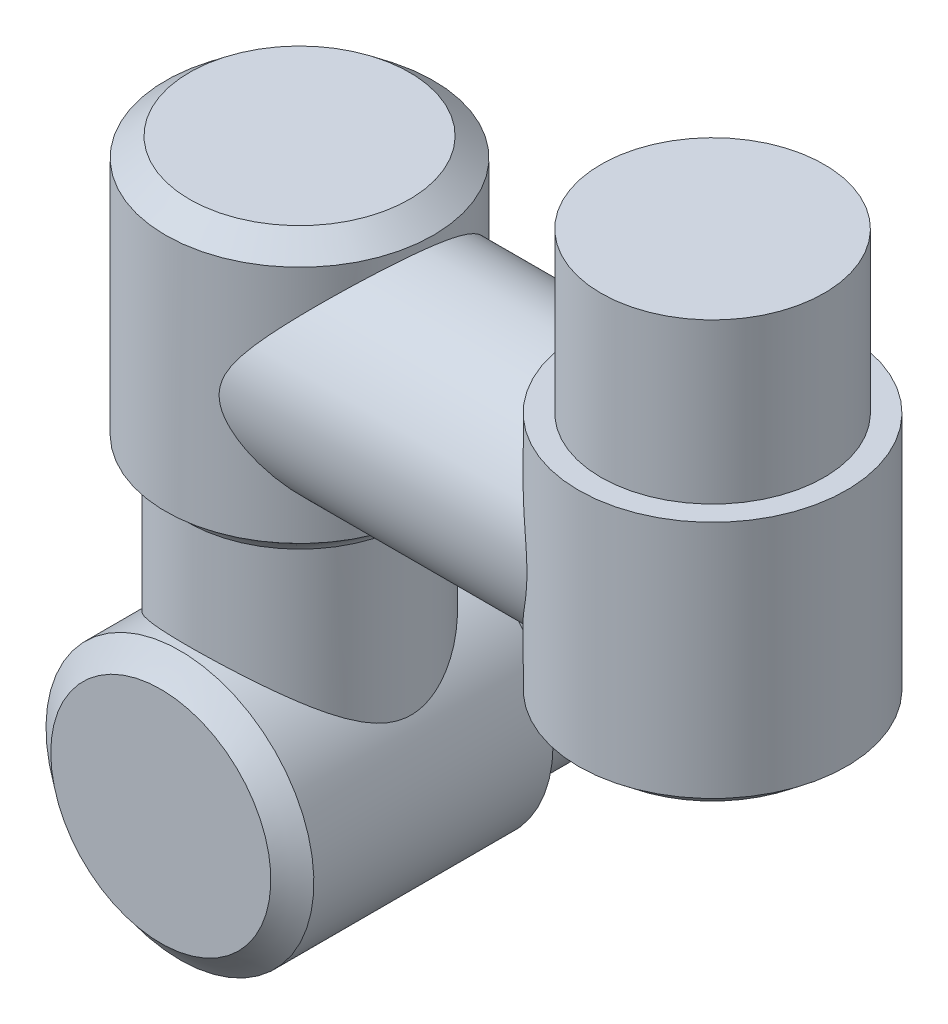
ISO-10303-21;
HEADER;
FILE_DESCRIPTION(('STEP AP214'),'2;1');
FILE_NAME('part.step','',(''),(''),'','','');
FILE_SCHEMA(('AUTOMOTIVE_DESIGN { 1 0 10303 214 1 1 1 1 }'));
ENDSEC;
DATA;
#1=APPLICATION_CONTEXT('core data for automotive mechanical design processes');
#2=APPLICATION_PROTOCOL_DEFINITION('international standard','automotive_design',2000,#1);
#3=PRODUCT_CONTEXT('',#1,'mechanical');
#4=PRODUCT('Part','Part','',(#3));
#5=PRODUCT_RELATED_PRODUCT_CATEGORY('part','',(#4));
#6=PRODUCT_DEFINITION_FORMATION('','',#4);
#7=PRODUCT_DEFINITION_CONTEXT('part definition',#1,'design');
#8=PRODUCT_DEFINITION('design','',#6,#7);
#9=PRODUCT_DEFINITION_SHAPE('','',#8);
#10=(LENGTH_UNIT() NAMED_UNIT(*) SI_UNIT(.MILLI.,.METRE.));
#11=(NAMED_UNIT(*) PLANE_ANGLE_UNIT() SI_UNIT($,.RADIAN.));
#12=(NAMED_UNIT(*) SI_UNIT($,.STERADIAN.) SOLID_ANGLE_UNIT());
#13=UNCERTAINTY_MEASURE_WITH_UNIT(LENGTH_MEASURE(1.E-05),#10,'distance_accuracy_value','');
#14=(GEOMETRIC_REPRESENTATION_CONTEXT(3) GLOBAL_UNCERTAINTY_ASSIGNED_CONTEXT((#13)) GLOBAL_UNIT_ASSIGNED_CONTEXT((#10,
#11,#12)) REPRESENTATION_CONTEXT('',''));
#15=CARTESIAN_POINT('',(0.,0.,0.));
#16=DIRECTION('',(0.,0.,1.));
#17=DIRECTION('',(1.,0.,0.));
#18=AXIS2_PLACEMENT_3D('',#15,#16,#17);
#19=CARTESIAN_POINT('',(0.,0.,375.));
#20=DIRECTION('',(0.,0.,-1.));
#21=DIRECTION('',(-1.,0.,0.));
#22=AXIS2_PLACEMENT_3D('',#19,#20,#21);
#23=CYLINDRICAL_SURFACE('',#22,210.);
#24=CARTESIAN_POINT('',(0.,0.,375.));
#25=DIRECTION('',(0.,0.,1.));
#26=DIRECTION('',(1.,0.,0.));
#27=AXIS2_PLACEMENT_3D('',#24,#25,#26);
#28=CIRCLE('',#27,210.);
#29=CARTESIAN_POINT('',(-139.960889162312,-156.559731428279,375.));
#30=VERTEX_POINT('',#29);
#31=EDGE_CURVE('E95',#30,#30,#28,.T.);
#32=ORIENTED_EDGE('',*,*,#31,.F.);
#33=EDGE_LOOP('',(#32));
#34=FACE_BOUND('',#33,.T.);
#35=CARTESIAN_POINT('',(0.,0.,0.));
#36=DIRECTION('',(0.,0.,1.));
#37=DIRECTION('',(1.,0.,0.));
#38=AXIS2_PLACEMENT_3D('',#35,#36,#37);
#39=CIRCLE('',#38,210.);
#40=CARTESIAN_POINT('',(210.,0.,0.));
#41=VERTEX_POINT('',#40);
#42=EDGE_CURVE('E92',#41,#41,#39,.T.);
#43=ORIENTED_EDGE('',*,*,#42,.T.);
#44=EDGE_LOOP('',(#43));
#45=FACE_BOUND('',#44,.T.);
#46=CARTESIAN_POINT('',(0.,210.,12.5));
#47=CARTESIAN_POINT('',(-2.07851005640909,209.999998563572,12.5000014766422));
#48=CARTESIAN_POINT('',(-4.15706454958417,209.969124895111,12.537046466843));
#49=CARTESIAN_POINT('',(-8.30974612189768,209.845808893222,12.6850545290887));
#50=CARTESIAN_POINT('',(-10.3838730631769,209.753364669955,12.7960198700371));
#51=CARTESIAN_POINT('',(-14.5234631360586,209.50744270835,13.0913556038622));
#52=CARTESIAN_POINT('',(-16.5889254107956,209.353959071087,13.2757330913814));
#53=CARTESIAN_POINT('',(-20.7066833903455,208.986856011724,13.7170291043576));
#54=CARTESIAN_POINT('',(-22.7589791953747,208.773237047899,13.9739470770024));
#55=CARTESIAN_POINT('',(-26.8475198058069,208.286944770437,14.5593225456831));
#56=CARTESIAN_POINT('',(-28.8837545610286,208.014237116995,14.8878216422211));
#57=CARTESIAN_POINT('',(-32.9350973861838,207.411363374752,15.6148205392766));
#58=CARTESIAN_POINT('',(-34.9502053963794,207.081197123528,16.0133205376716));
#59=CARTESIAN_POINT('',(-38.9556420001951,206.365202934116,16.878617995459));
#60=CARTESIAN_POINT('',(-40.94597117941,205.979376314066,17.3454138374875));
#61=CARTESIAN_POINT('',(-44.8985962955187,205.154069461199,18.3454200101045));
#62=CARTESIAN_POINT('',(-46.8608922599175,204.714589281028,18.878630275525));
#63=CARTESIAN_POINT('',(-50.742621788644,203.787007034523,20.0059815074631));
#64=CARTESIAN_POINT('',(-52.6622434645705,203.299216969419,20.5997321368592));
#65=CARTESIAN_POINT('',(-56.4682267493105,202.275117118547,21.848707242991));
#66=CARTESIAN_POINT('',(-58.3545884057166,201.738807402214,22.5039316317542));
#67=CARTESIAN_POINT('',(-62.0915966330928,200.620132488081,23.8736155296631));
#68=CARTESIAN_POINT('',(-63.942246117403,200.037771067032,24.5880701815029));
#69=CARTESIAN_POINT('',(-67.6061504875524,198.829398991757,26.0741131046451));
#70=CARTESIAN_POINT('',(-69.419402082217,198.203384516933,26.8457063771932));
#71=CARTESIAN_POINT('',(-73.0066789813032,196.910284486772,28.4437817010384));
#72=CARTESIAN_POINT('',(-74.7807032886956,196.243197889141,29.2702651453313));
#73=CARTESIAN_POINT('',(-78.2881934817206,194.870484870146,30.9760012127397));
#74=CARTESIAN_POINT('',(-80.0216556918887,194.164854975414,31.8552585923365));
#75=CARTESIAN_POINT('',(-83.4467458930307,192.717661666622,33.6644000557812));
#76=CARTESIAN_POINT('',(-85.1383720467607,191.976096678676,34.5942863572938));
#77=CARTESIAN_POINT('',(-88.4787733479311,190.459632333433,36.5026257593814));
#78=CARTESIAN_POINT('',(-90.127546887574,189.684731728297,37.4810806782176));
#79=CARTESIAN_POINT('',(-93.9793815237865,187.813719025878,39.8527779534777));
#80=CARTESIAN_POINT('',(-96.1634889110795,186.704208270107,41.2663187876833));
#81=CARTESIAN_POINT('',(-100.448661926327,184.434124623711,44.1759803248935));
#82=CARTESIAN_POINT('',(-102.549721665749,183.273548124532,45.6721068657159));
#83=CARTESIAN_POINT('',(-106.668322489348,180.907464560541,48.7431287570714));
#84=CARTESIAN_POINT('',(-108.685840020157,179.701945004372,50.3180460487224));
#85=CARTESIAN_POINT('',(-112.636097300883,177.252674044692,53.5425063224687));
#86=CARTESIAN_POINT('',(-114.568838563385,176.008923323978,55.1920479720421));
#87=CARTESIAN_POINT('',(-118.354011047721,173.486350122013,58.5667872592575));
#88=CARTESIAN_POINT('',(-120.206229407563,172.207447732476,60.292163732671));
#89=CARTESIAN_POINT('',(-123.82509075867,169.623965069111,63.8120117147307));
#90=CARTESIAN_POINT('',(-125.591733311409,168.319384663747,65.6064835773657));
#91=CARTESIAN_POINT('',(-129.039161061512,165.691255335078,69.2620781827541));
#92=CARTESIAN_POINT('',(-130.719958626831,164.367709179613,71.1231912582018));
#93=CARTESIAN_POINT('',(-133.995957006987,161.708177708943,74.9106889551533));
#94=CARTESIAN_POINT('',(-135.591157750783,160.372192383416,76.8370736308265));
#95=CARTESIAN_POINT('',(-138.724443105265,157.670183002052,80.7900825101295));
#96=CARTESIAN_POINT('',(-140.260937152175,156.304058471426,82.8178988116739));
#97=CARTESIAN_POINT('',(-143.244822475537,153.574118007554,86.9396000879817));
#98=CARTESIAN_POINT('',(-144.692213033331,152.210302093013,89.0334855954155));
#99=CARTESIAN_POINT('',(-147.497853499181,149.493136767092,93.2881164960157));
#100=CARTESIAN_POINT('',(-148.856072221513,148.139791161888,95.4488848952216));
#101=CARTESIAN_POINT('',(-151.481917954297,145.453620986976,99.8371989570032));
#102=CARTESIAN_POINT('',(-152.749546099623,144.120796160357,102.06474378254));
#103=CARTESIAN_POINT('',(-155.189948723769,141.489545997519,106.58241565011));
#104=CARTESIAN_POINT('',(-156.362941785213,140.191046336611,108.872381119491));
#105=CARTESIAN_POINT('',(-158.615497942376,137.637286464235,113.521647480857));
#106=CARTESIAN_POINT('',(-159.695056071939,136.382028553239,115.880952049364));
#107=CARTESIAN_POINT('',(-161.757192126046,133.929739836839,120.668868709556));
#108=CARTESIAN_POINT('',(-162.739838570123,132.732668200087,123.097430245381));
#109=CARTESIAN_POINT('',(-164.605183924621,130.412227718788,128.026679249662));
#110=CARTESIAN_POINT('',(-165.487901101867,129.288845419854,130.5273534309));
#111=CARTESIAN_POINT('',(-167.227100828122,127.032717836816,135.841201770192));
#112=CARTESIAN_POINT('',(-168.073292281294,125.909045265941,138.661634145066));
#113=CARTESIAN_POINT('',(-169.632935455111,123.799792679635,144.389990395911));
#114=CARTESIAN_POINT('',(-170.346405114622,122.814194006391,147.2979023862));
#115=CARTESIAN_POINT('',(-171.309502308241,121.46340938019,151.718385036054));
#116=CARTESIAN_POINT('',(-171.612453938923,121.03475250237,153.200258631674));
#117=CARTESIAN_POINT('',(-172.181814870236,120.223409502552,156.183426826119));
#118=CARTESIAN_POINT('',(-172.448227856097,119.840718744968,157.684719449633));
#119=CARTESIAN_POINT('',(-172.94334184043,119.125102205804,160.70553242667));
#120=CARTESIAN_POINT('',(-173.172037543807,118.79218341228,162.225055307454));
#121=CARTESIAN_POINT('',(-173.590465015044,118.179896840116,165.280031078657));
#122=CARTESIAN_POINT('',(-173.78020126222,117.900522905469,166.815482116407));
#123=CARTESIAN_POINT('',(-174.121787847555,117.395473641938,169.91956846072));
#124=CARTESIAN_POINT('',(-174.273129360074,117.170521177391,171.488377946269));
#125=CARTESIAN_POINT('',(-174.533780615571,116.781908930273,174.637073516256));
#126=CARTESIAN_POINT('',(-174.643090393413,116.618249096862,176.216959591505));
#127=CARTESIAN_POINT('',(-174.818909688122,116.354518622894,179.384316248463));
#128=CARTESIAN_POINT('',(-174.88542219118,116.254443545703,180.97178629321));
#129=CARTESIAN_POINT('',(-174.975171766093,116.119317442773,184.150724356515));
#130=CARTESIAN_POINT('',(-174.998408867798,116.084266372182,185.742192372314));
#131=CARTESIAN_POINT('',(-175.001433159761,116.079707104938,188.925270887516));
#132=CARTESIAN_POINT('',(-174.981220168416,116.110199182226,190.516881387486));
#133=CARTESIAN_POINT('',(-174.897496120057,116.236274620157,193.696363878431));
#134=CARTESIAN_POINT('',(-174.83398517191,116.331857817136,195.284235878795));
#135=CARTESIAN_POINT('',(-174.664123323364,116.586737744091,198.452683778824));
#136=CARTESIAN_POINT('',(-174.557768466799,116.746040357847,200.033258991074));
#137=CARTESIAN_POINT('',(-174.302963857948,117.126124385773,203.183570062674));
#138=CARTESIAN_POINT('',(-174.154513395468,117.346906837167,204.753305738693));
#139=CARTESIAN_POINT('',(-173.802461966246,117.867769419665,208.008583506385));
#140=CARTESIAN_POINT('',(-173.595307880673,118.172907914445,209.692931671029));
#141=CARTESIAN_POINT('',(-173.134206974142,118.847436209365,213.042207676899));
#142=CARTESIAN_POINT('',(-172.880258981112,119.216827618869,214.707135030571));
#143=CARTESIAN_POINT('',(-172.327130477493,120.014981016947,218.015115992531));
#144=CARTESIAN_POINT('',(-172.0279485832,120.443744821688,219.658168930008));
#145=CARTESIAN_POINT('',(-171.385956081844,121.355531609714,222.920600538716));
#146=CARTESIAN_POINT('',(-171.043140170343,121.838561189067,224.539976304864));
#147=CARTESIAN_POINT('',(-169.949685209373,123.363978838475,229.369044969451));
#148=CARTESIAN_POINT('',(-169.135459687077,124.480616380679,232.541259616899));
#149=CARTESIAN_POINT('',(-167.349759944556,126.871123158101,238.77954276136));
#150=CARTESIAN_POINT('',(-166.378270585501,128.145007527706,241.845601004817));
#151=CARTESIAN_POINT('',(-164.502416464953,130.540305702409,247.252607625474));
#152=CARTESIAN_POINT('',(-163.625275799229,131.639264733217,249.6130986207));
#153=CARTESIAN_POINT('',(-161.781298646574,133.898983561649,254.268867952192));
#154=CARTESIAN_POINT('',(-160.814450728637,135.059751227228,256.564137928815));
#155=CARTESIAN_POINT('',(-158.793608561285,137.430043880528,261.091701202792));
#156=CARTESIAN_POINT('',(-157.739572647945,138.639592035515,263.323963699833));
#157=CARTESIAN_POINT('',(-155.546981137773,141.095166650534,267.7258207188));
#158=CARTESIAN_POINT('',(-154.40842865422,142.341191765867,269.895417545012));
#159=CARTESIAN_POINT('',(-152.04677815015,144.86118675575,274.176183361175));
#160=CARTESIAN_POINT('',(-150.823568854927,146.135191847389,276.287270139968));
#161=CARTESIAN_POINT('',(-148.295061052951,148.700432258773,280.448926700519));
#162=CARTESIAN_POINT('',(-146.989762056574,149.991667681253,282.499496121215));
#163=CARTESIAN_POINT('',(-144.298087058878,152.58293296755,286.540162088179));
#164=CARTESIAN_POINT('',(-142.911728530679,153.882960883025,288.530271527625));
#165=CARTESIAN_POINT('',(-140.058102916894,156.484683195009,292.450490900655));
#166=CARTESIAN_POINT('',(-138.590835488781,157.78637759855,294.380600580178));
#167=CARTESIAN_POINT('',(-135.496666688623,160.45260807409,298.279816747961));
#168=CARTESIAN_POINT('',(-133.865429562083,161.816866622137,300.245675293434));
#169=CARTESIAN_POINT('',(-130.513664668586,164.532171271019,304.109277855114));
#170=CARTESIAN_POINT('',(-128.793136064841,165.883217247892,306.007021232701));
#171=CARTESIAN_POINT('',(-125.262517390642,168.565171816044,309.732931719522));
#172=CARTESIAN_POINT('',(-123.452412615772,169.896077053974,311.561087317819));
#173=CARTESIAN_POINT('',(-119.742947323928,172.5305821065,315.145124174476));
#174=CARTESIAN_POINT('',(-117.843587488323,173.834182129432,316.901005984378));
#175=CARTESIAN_POINT('',(-113.959358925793,176.404870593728,320.334373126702));
#176=CARTESIAN_POINT('',(-111.974655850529,177.672022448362,322.011998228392));
#177=CARTESIAN_POINT('',(-107.916763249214,180.165599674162,325.288871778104));
#178=CARTESIAN_POINT('',(-105.843572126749,181.392024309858,326.888118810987));
#179=CARTESIAN_POINT('',(-101.610010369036,183.796983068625,330.003724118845));
#180=CARTESIAN_POINT('',(-99.4496640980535,184.975530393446,331.52010528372));
#181=CARTESIAN_POINT('',(-95.0424319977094,187.278179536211,334.465847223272));
#182=CARTESIAN_POINT('',(-92.7955521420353,188.40228510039,335.895213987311));
#183=CARTESIAN_POINT('',(-88.7767040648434,190.321757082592,338.323674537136));
#184=CARTESIAN_POINT('',(-87.0229261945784,191.130305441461,339.342527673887));
#185=CARTESIAN_POINT('',(-83.4679066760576,192.70934324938,341.325390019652));
#186=CARTESIAN_POINT('',(-81.6666669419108,193.479834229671,342.289401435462));
#187=CARTESIAN_POINT('',(-78.0180768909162,194.979665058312,344.160084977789));
#188=CARTESIAN_POINT('',(-76.1707306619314,195.709008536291,345.066762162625));
#189=CARTESIAN_POINT('',(-72.431263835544,197.123585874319,346.820358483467));
#190=CARTESIAN_POINT('',(-70.5391428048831,197.808819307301,347.667277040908));
#191=CARTESIAN_POINT('',(-66.7126950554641,199.131897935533,349.298455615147));
#192=CARTESIAN_POINT('',(-64.7783843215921,199.769760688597,350.082738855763));
#193=CARTESIAN_POINT('',(-60.8690636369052,200.995405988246,351.586388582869));
#194=CARTESIAN_POINT('',(-58.8940538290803,201.583188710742,352.305755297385));
#195=CARTESIAN_POINT('',(-54.905799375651,202.705808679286,353.677013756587));
#196=CARTESIAN_POINT('',(-52.8925532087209,203.240643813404,354.328902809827));
#197=CARTESIAN_POINT('',(-48.8308364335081,204.254573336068,355.56264978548));
#198=CARTESIAN_POINT('',(-46.7823657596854,204.733667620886,356.144507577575));
#199=CARTESIAN_POINT('',(-42.6374516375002,205.637014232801,357.240031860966));
#200=CARTESIAN_POINT('',(-40.5407588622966,206.060810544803,357.75313217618));
#201=CARTESIAN_POINT('',(-36.3187791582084,206.846698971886,358.703470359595));
#202=CARTESIAN_POINT('',(-34.1934921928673,207.208791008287,359.140708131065));
#203=CARTESIAN_POINT('',(-29.9184615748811,207.869102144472,359.937273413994));
#204=CARTESIAN_POINT('',(-27.7687174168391,208.167319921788,360.29659931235));
#205=CARTESIAN_POINT('',(-23.4493479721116,208.698017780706,360.935562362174));
#206=CARTESIAN_POINT('',(-21.2797227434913,208.930498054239,361.215199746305));
#207=CARTESIAN_POINT('',(-16.9265382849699,209.328132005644,361.693238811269));
#208=CARTESIAN_POINT('',(-14.7429868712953,209.493320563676,361.891682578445));
#209=CARTESIAN_POINT('',(-10.3658658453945,209.755466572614,362.206506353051));
#210=CARTESIAN_POINT('',(-8.17229616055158,209.852423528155,362.32288576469));
#211=CARTESIAN_POINT('',(-3.780578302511,209.977457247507,362.472952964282));
#212=CARTESIAN_POINT('',(-1.58243058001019,210.005540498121,362.506648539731));
#213=CARTESIAN_POINT('',(2.81333049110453,209.992655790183,362.491187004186));
#214=CARTESIAN_POINT('',(5.01094385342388,209.951689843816,362.442032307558));
#215=CARTESIAN_POINT('',(9.13697699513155,209.81003494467,362.272001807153));
#216=CARTESIAN_POINT('',(11.066057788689,209.717101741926,362.160439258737));
#217=CARTESIAN_POINT('',(14.9161834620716,209.478464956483,361.87383289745));
#218=CARTESIAN_POINT('',(16.8372285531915,209.332762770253,361.698790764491));
#219=CARTESIAN_POINT('',(20.6676921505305,208.989339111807,361.285951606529));
#220=CARTESIAN_POINT('',(22.5771117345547,208.791622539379,361.048160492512));
#221=CARTESIAN_POINT('',(26.3812286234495,208.345142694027,360.510753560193));
#222=CARTESIAN_POINT('',(28.2759258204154,208.09637904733,360.211137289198));
#223=CARTESIAN_POINT('',(32.0475281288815,207.548999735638,359.55121695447));
#224=CARTESIAN_POINT('',(33.9244325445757,207.250382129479,359.190910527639));
#225=CARTESIAN_POINT('',(37.6574418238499,206.604707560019,358.410950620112));
#226=CARTESIAN_POINT('',(39.513546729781,206.257650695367,357.99129726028));
#227=CARTESIAN_POINT('',(43.2023153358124,205.516663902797,357.094112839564));
#228=CARTESIAN_POINT('',(45.0349782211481,205.122732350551,356.61657977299));
#229=CARTESIAN_POINT('',(48.6743230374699,204.289733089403,355.605256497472));
#230=CARTESIAN_POINT('',(50.4810048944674,203.850665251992,355.071466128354));
#231=CARTESIAN_POINT('',(54.0898667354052,202.923145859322,353.941906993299));
#232=CARTESIAN_POINT('',(55.8916709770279,202.434117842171,353.345411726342));
#233=CARTESIAN_POINT('',(59.4643791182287,201.413603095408,352.098201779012));
#234=CARTESIAN_POINT('',(61.2352803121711,200.882112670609,351.447482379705));
#235=CARTESIAN_POINT('',(64.7440086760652,199.7788646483,350.093814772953));
#236=CARTESIAN_POINT('',(66.4818398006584,199.207111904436,349.390872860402));
#237=CARTESIAN_POINT('',(69.9231082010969,198.025427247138,347.934568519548));
#238=CARTESIAN_POINT('',(71.626542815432,197.415492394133,347.181202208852));
#239=CARTESIAN_POINT('',(76.6834178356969,195.531560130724,344.848130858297));
#240=CARTESIAN_POINT('',(79.9835036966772,194.203411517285,343.195424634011));
#241=CARTESIAN_POINT('',(86.431897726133,191.420646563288,339.710265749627));
#242=CARTESIAN_POINT('',(89.5801855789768,189.966013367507,337.877789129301));
#243=CARTESIAN_POINT('',(94.8744045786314,187.363270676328,334.573878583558));
#244=CARTESIAN_POINT('',(97.0578058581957,186.24093381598,333.141817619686));
#245=CARTESIAN_POINT('',(101.340728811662,183.945534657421,330.19482840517));
#246=CARTESIAN_POINT('',(103.440243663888,182.772468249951,328.679893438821));
#247=CARTESIAN_POINT('',(107.554871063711,180.381853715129,325.571000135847));
#248=CARTESIAN_POINT('',(109.569956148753,179.164291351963,323.9770164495));
#249=CARTESIAN_POINT('',(113.514445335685,176.69150783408,320.714195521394));
#250=CARTESIAN_POINT('',(115.443851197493,175.436287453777,319.045359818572));
#251=CARTESIAN_POINT('',(119.222064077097,172.891013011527,315.631185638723));
#252=CARTESIAN_POINT('',(121.07062866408,171.600870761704,313.885644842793));
#253=CARTESIAN_POINT('',(124.681268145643,168.995672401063,310.325119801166));
#254=CARTESIAN_POINT('',(126.443342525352,167.680616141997,308.510135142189));
#255=CARTESIAN_POINT('',(129.880699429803,165.032451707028,304.813144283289));
#256=CARTESIAN_POINT('',(131.555995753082,163.699346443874,302.931148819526));
#257=CARTESIAN_POINT('',(134.820078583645,161.021744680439,299.101419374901));
#258=CARTESIAN_POINT('',(136.408865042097,159.677248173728,297.153685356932));
#259=CARTESIAN_POINT('',(139.527487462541,156.959974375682,293.158022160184));
#260=CARTESIAN_POINT('',(141.055759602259,155.587121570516,291.108923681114));
#261=CARTESIAN_POINT('',(144.022277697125,152.845225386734,286.944056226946));
#262=CARTESIAN_POINT('',(145.460522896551,151.476182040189,284.82828669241));
#263=CARTESIAN_POINT('',(148.246917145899,148.75029857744,280.529113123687));
#264=CARTESIAN_POINT('',(149.595032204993,147.393463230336,278.345684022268));
#265=CARTESIAN_POINT('',(152.199579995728,144.702432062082,273.911225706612));
#266=CARTESIAN_POINT('',(153.456013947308,143.368235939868,271.660197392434));
#267=CARTESIAN_POINT('',(155.872489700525,140.73716150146,267.09534259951));
#268=CARTESIAN_POINT('',(157.032779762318,139.440193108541,264.781699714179));
#269=CARTESIAN_POINT('',(159.258609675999,136.892499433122,260.084096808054));
#270=CARTESIAN_POINT('',(160.324144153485,135.641776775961,257.700132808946));
#271=CARTESIAN_POINT('',(162.356654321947,133.202234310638,252.862038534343));
#272=CARTESIAN_POINT('',(163.323704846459,132.013367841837,250.407963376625));
#273=CARTESIAN_POINT('',(165.156073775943,129.713656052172,245.4267792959));
#274=CARTESIAN_POINT('',(166.021412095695,128.602795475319,242.899684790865));
#275=CARTESIAN_POINT('',(167.709992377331,126.393990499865,237.5678232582));
#276=CARTESIAN_POINT('',(168.524456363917,125.304053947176,234.756927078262));
#277=CARTESIAN_POINT('',(170.021527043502,123.265085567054,229.049700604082));
#278=CARTESIAN_POINT('',(170.704151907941,122.316034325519,226.153382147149));
#279=CARTESIAN_POINT('',(171.62170053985,121.021779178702,221.752485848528));
#280=CARTESIAN_POINT('',(171.90959480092,120.612243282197,220.277549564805));
#281=CARTESIAN_POINT('',(172.449108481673,119.839588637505,217.309058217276));
#282=CARTESIAN_POINT('',(172.700731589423,119.476465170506,215.815505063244));
#283=CARTESIAN_POINT('',(173.166567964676,118.80028799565,212.811084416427));
#284=CARTESIAN_POINT('',(173.380776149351,118.487241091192,211.300214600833));
#285=CARTESIAN_POINT('',(173.770590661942,117.914807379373,208.263543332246));
#286=CARTESIAN_POINT('',(173.946201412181,117.65541442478,206.737743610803));
#287=CARTESIAN_POINT('',(174.259681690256,117.190626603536,203.655240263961));
#288=CARTESIAN_POINT('',(174.397075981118,116.985912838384,202.098385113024));
#289=CARTESIAN_POINT('',(174.630417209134,116.637307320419,198.974761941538));
#290=CARTESIAN_POINT('',(174.726364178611,116.493415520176,197.407993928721));
#291=CARTESIAN_POINT('',(174.876139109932,116.268457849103,194.268027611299));
#292=CARTESIAN_POINT('',(174.929969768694,116.187387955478,192.694829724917));
#293=CARTESIAN_POINT('',(174.995132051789,116.089221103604,189.545551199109));
#294=CARTESIAN_POINT('',(175.006463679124,116.072124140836,187.969470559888));
#295=CARTESIAN_POINT('',(174.986542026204,116.102155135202,184.817848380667));
#296=CARTESIAN_POINT('',(174.955279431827,116.149297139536,183.242307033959));
#297=CARTESIAN_POINT('',(174.85038282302,116.307147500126,180.095846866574));
#298=CARTESIAN_POINT('',(174.776748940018,116.417855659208,178.524928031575));
#299=CARTESIAN_POINT('',(174.587624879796,116.701286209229,175.391089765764));
#300=CARTESIAN_POINT('',(174.472130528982,116.874014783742,173.828171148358));
#301=CARTESIAN_POINT('',(174.200068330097,117.279135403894,170.713697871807));
#302=CARTESIAN_POINT('',(174.043499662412,117.511528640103,169.162143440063));
#303=CARTESIAN_POINT('',(173.671508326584,118.060698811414,165.909164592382));
#304=CARTESIAN_POINT('',(173.451601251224,118.383816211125,164.209322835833));
#305=CARTESIAN_POINT('',(172.964253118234,119.094721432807,160.830134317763));
#306=CARTESIAN_POINT('',(172.696810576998,119.482511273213,159.150788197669));
#307=CARTESIAN_POINT('',(172.116018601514,120.317640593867,155.814947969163));
#308=CARTESIAN_POINT('',(171.802666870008,120.764983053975,154.158455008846));
#309=CARTESIAN_POINT('',(171.131718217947,121.713897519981,150.870068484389));
#310=CARTESIAN_POINT('',(170.774115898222,122.215476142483,149.238177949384));
#311=CARTESIAN_POINT('',(169.635377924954,123.796310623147,144.372830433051));
#312=CARTESIAN_POINT('',(168.789789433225,124.949509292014,141.178111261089));
#313=CARTESIAN_POINT('',(166.939220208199,127.411407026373,134.897513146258));
#314=CARTESIAN_POINT('',(165.934225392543,128.720119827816,131.811643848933));
#315=CARTESIAN_POINT('',(163.995207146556,131.177351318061,126.367966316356));
#316=CARTESIAN_POINT('',(163.088686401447,132.303913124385,123.990301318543));
#317=CARTESIAN_POINT('',(161.184302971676,134.617476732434,119.301580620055));
#318=CARTESIAN_POINT('',(160.186428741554,135.80448616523,116.990533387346));
#319=CARTESIAN_POINT('',(158.101824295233,138.225782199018,112.4327240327));
#320=CARTESIAN_POINT('',(157.015051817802,139.460091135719,110.185993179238));
#321=CARTESIAN_POINT('',(154.755225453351,141.96360049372,105.75648826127));
#322=CARTESIAN_POINT('',(153.582174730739,143.232799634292,103.573711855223));
#323=CARTESIAN_POINT('',(151.149659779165,145.797491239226,99.2679045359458));
#324=CARTESIAN_POINT('',(149.890082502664,147.093016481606,97.144957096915));
#325=CARTESIAN_POINT('',(147.286938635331,149.699534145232,92.9609702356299));
#326=CARTESIAN_POINT('',(145.943371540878,151.010526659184,90.8999311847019));
#327=CARTESIAN_POINT('',(143.173206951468,153.639443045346,86.8398243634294));
#328=CARTESIAN_POINT('',(141.746627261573,154.957365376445,84.8407434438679));
#329=CARTESIAN_POINT('',(138.810547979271,157.592904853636,80.9042173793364));
#330=CARTESIAN_POINT('',(137.301048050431,158.910521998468,78.966772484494));
#331=CARTESIAN_POINT('',(134.123033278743,161.603094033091,75.0604177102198));
#332=CARTESIAN_POINT('',(132.450349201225,162.977682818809,73.0946444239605));
#333=CARTESIAN_POINT('',(129.013942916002,165.711264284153,69.2330023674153));
#334=CARTESIAN_POINT('',(127.250219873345,167.0702568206,67.3371342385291));
#335=CARTESIAN_POINT('',(123.631433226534,169.765602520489,63.6169763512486));
#336=CARTESIAN_POINT('',(121.776353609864,171.101951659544,61.7926992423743));
#337=CARTESIAN_POINT('',(117.97521061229,173.744662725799,58.2186981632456));
#338=CARTESIAN_POINT('',(116.029147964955,175.051024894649,56.4689735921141));
#339=CARTESIAN_POINT('',(112.049973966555,177.624341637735,53.0504919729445));
#340=CARTESIAN_POINT('',(110.017033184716,178.891365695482,51.3815888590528));
#341=CARTESIAN_POINT('',(105.861103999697,181.381627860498,48.1249812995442));
#342=CARTESIAN_POINT('',(103.738113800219,182.604865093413,46.537278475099));
#343=CARTESIAN_POINT('',(99.4036515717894,185.000117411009,43.4479444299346));
#344=CARTESIAN_POINT('',(97.192207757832,186.172148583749,41.9462861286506));
#345=CARTESIAN_POINT('',(92.681612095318,188.458245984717,39.0334211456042));
#346=CARTESIAN_POINT('',(90.3824669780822,189.572316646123,37.6222075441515));
#347=CARTESIAN_POINT('',(86.3051253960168,191.455163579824,35.2487022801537));
#348=CARTESIAN_POINT('',(84.5462371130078,192.238636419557,34.2648075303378));
#349=CARTESIAN_POINT('',(80.9824277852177,193.766883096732,32.351890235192));
#350=CARTESIAN_POINT('',(79.1775083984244,194.511658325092,31.4228657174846));
#351=CARTESIAN_POINT('',(75.5230363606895,195.959520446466,29.6221351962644));
#352=CARTESIAN_POINT('',(73.6734863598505,196.6626098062,28.7504258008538));
#353=CARTESIAN_POINT('',(69.9312343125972,198.024208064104,27.0667360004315));
#354=CARTESIAN_POINT('',(68.038531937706,198.682716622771,26.2547560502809));
#355=CARTESIAN_POINT('',(64.2138753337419,199.95157790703,24.6938579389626));
#356=CARTESIAN_POINT('',(62.2819631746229,200.56197913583,23.9448762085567));
#357=CARTESIAN_POINT('',(58.3793133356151,201.732510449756,22.5115858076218));
#358=CARTESIAN_POINT('',(56.4085763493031,202.292641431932,21.827275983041));
#359=CARTESIAN_POINT('',(52.4310580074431,203.359837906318,20.5258632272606));
#360=CARTESIAN_POINT('',(50.424279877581,203.866908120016,19.9087543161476));
#361=CARTESIAN_POINT('',(46.3775484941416,204.825404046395,18.7440946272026));
#362=CARTESIAN_POINT('',(44.337596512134,205.276831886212,18.1965411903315));
#363=CARTESIAN_POINT('',(40.5779567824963,206.049651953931,17.260414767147));
#364=CARTESIAN_POINT('',(38.8629032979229,206.380096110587,16.8606485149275));
#365=CARTESIAN_POINT('',(35.414408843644,206.999730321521,16.1117489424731));
#366=CARTESIAN_POINT('',(33.680968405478,207.288921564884,15.7626141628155));
#367=CARTESIAN_POINT('',(30.1981465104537,207.824868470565,15.116101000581));
#368=CARTESIAN_POINT('',(28.4487668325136,208.071628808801,14.8187169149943));
#369=CARTESIAN_POINT('',(24.9362883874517,208.521741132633,14.2766200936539));
#370=CARTESIAN_POINT('',(23.1731895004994,208.725092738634,14.0319078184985));
#371=CARTESIAN_POINT('',(19.6359207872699,209.08752085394,13.5959861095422));
#372=CARTESIAN_POINT('',(17.8617513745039,209.246599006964,13.404774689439));
#373=CARTESIAN_POINT('',(14.3049730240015,209.519805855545,13.0765000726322));
#374=CARTESIAN_POINT('',(12.5223641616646,209.633934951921,12.9394363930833));
#375=CARTESIAN_POINT('',(8.95123435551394,209.816758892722,12.7199210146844));
#376=CARTESIAN_POINT('',(7.1627127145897,209.885448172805,12.6374760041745));
#377=CARTESIAN_POINT('',(3.58280507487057,209.977069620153,12.5275145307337));
#378=CARTESIAN_POINT('',(1.79141904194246,210.000001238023,12.4999987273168));
#379=CARTESIAN_POINT('',(0.,210.,12.5));
#380=B_SPLINE_CURVE_WITH_KNOTS('',3,(#46,#47,#48,#49,#50,#51,#52,#53,#54,#55,#56,#57,#58,#59,
#60,#61,#62,#63,#64,#65,#66,#67,#68,#69,#70,#71,#72,#73,#74,#75,#76,#77,#78,#79,#80,#81,#82,#83,
#84,#85,#86,#87,#88,#89,#90,#91,#92,#93,#94,#95,#96,#97,#98,#99,#100,#101,#102,#103,#104,#105,
#106,#107,#108,#109,#110,#111,#112,#113,#114,#115,#116,#117,#118,#119,#120,#121,#122,#123,#124,
#125,#126,#127,#128,#129,#130,#131,#132,#133,#134,#135,#136,#137,#138,#139,#140,#141,#142,#143,
#144,#145,#146,#147,#148,#149,#150,#151,#152,#153,#154,#155,#156,#157,#158,#159,#160,#161,#162,
#163,#164,#165,#166,#167,#168,#169,#170,#171,#172,#173,#174,#175,#176,#177,#178,#179,#180,#181,
#182,#183,#184,#185,#186,#187,#188,#189,#190,#191,#192,#193,#194,#195,#196,#197,#198,#199,#200,
#201,#202,#203,#204,#205,#206,#207,#208,#209,#210,#211,#212,#213,#214,#215,#216,#217,#218,#219,
#220,#221,#222,#223,#224,#225,#226,#227,#228,#229,#230,#231,#232,#233,#234,#235,#236,#237,#238,
#239,#240,#241,#242,#243,#244,#245,#246,#247,#248,#249,#250,#251,#252,#253,#254,#255,#256,#257,
#258,#259,#260,#261,#262,#263,#264,#265,#266,#267,#268,#269,#270,#271,#272,#273,#274,#275,#276,
#277,#278,#279,#280,#281,#282,#283,#284,#285,#286,#287,#288,#289,#290,#291,#292,#293,#294,#295,
#296,#297,#298,#299,#300,#301,#302,#303,#304,#305,#306,#307,#308,#309,#310,#311,#312,#313,#314,
#315,#316,#317,#318,#319,#320,#321,#322,#323,#324,#325,#326,#327,#328,#329,#330,#331,#332,#333,
#334,#335,#336,#337,#338,#339,#340,#341,#342,#343,#344,#345,#346,#347,#348,#349,#350,#351,#352,
#353,#354,#355,#356,#357,#358,#359,#360,#361,#362,#363,#364,#365,#366,#367,#368,#369,#370,#371,
#372,#373,#374,#375,#376,#377,#378,#379),.UNSPECIFIED.,.T.,.F.,(4,2,2,2,2,2,2,2,2,2,2,2,2,2,2,2,
2,2,2,2,2,2,2,2,2,2,2,2,2,2,2,2,2,2,2,2,2,2,2,2,2,2,2,2,2,2,2,2,2,2,2,2,2,2,2,2,2,2,2,2,2,2,2,2,
2,2,2,2,2,2,2,2,2,2,2,2,2,2,2,2,2,2,2,2,2,2,2,2,2,2,2,2,2,2,2,2,2,2,2,2,2,2,2,2,2,2,2,2,2,2,2,2,
2,2,2,2,2,2,2,2,2,2,2,2,2,2,2,2,2,2,2,2,2,2,2,2,2,2,2,2,2,2,2,2,2,2,2,2,2,2,2,2,2,2,2,2,2,2,2,2,
2,2,2,2,2,2,4),(0.,6.23504923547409,12.4702898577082,18.7061332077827,24.9419290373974,
31.1813586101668,37.4208058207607,43.6601052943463,49.8993986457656,56.1007415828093,
62.3020756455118,68.5029016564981,74.7042710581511,80.90579789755,87.1078845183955,
93.3102430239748,99.5128339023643,107.994661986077,116.477090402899,124.961894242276,
133.44654663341,141.95241133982,150.458319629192,158.962998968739,167.467685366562,
176.12882537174,184.790035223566,193.454258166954,202.118372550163,210.761865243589,
219.405817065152,228.043612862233,236.679827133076,246.128984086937,255.576862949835,
260.292137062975,265.00693525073,269.722394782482,274.437311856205,279.21178501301,
283.986254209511,288.760390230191,293.534522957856,298.308675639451,303.082816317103,
307.857397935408,312.632060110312,317.802753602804,322.973576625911,328.144557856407,
333.316168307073,343.685672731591,354.056175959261,362.295791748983,370.536458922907,
378.781087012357,387.025411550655,395.280786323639,403.536210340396,411.789861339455,
420.043547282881,428.729309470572,437.415153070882,446.102427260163,454.789635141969,
463.460681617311,472.131884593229,480.800680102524,489.468878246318,496.017879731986,
502.566617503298,509.114776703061,515.662999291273,522.208782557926,528.754542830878,
535.300564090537,541.846597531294,548.443595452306,555.040601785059,561.637744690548,
568.234868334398,574.828568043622,581.422315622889,588.015442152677,594.608376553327,
600.410246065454,606.211962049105,612.013131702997,617.814343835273,623.615781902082,
629.417208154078,635.218835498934,641.020479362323,646.898873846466,652.777780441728,
658.655979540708,664.534631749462,676.291687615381,688.050312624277,696.573886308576,
705.098151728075,713.625168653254,722.152010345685,730.702878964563,739.253798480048,
747.803354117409,756.352914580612,765.055478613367,773.758115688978,782.464016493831,
791.169801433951,799.852356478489,808.535403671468,817.211802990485,825.886500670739,
835.249008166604,844.610224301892,849.281937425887,853.9531751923,858.625047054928,
863.296383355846,868.023447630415,872.750508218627,877.47726608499,882.204023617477,
886.93181492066,891.659591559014,896.387839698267,901.116182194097,906.346667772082,
911.577316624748,916.808227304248,922.039776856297,932.529226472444,943.019603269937,
951.365092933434,959.711638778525,968.062175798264,976.412406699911,984.773762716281,
993.135168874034,1001.4947881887,1009.85444142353,1018.62511712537,1027.39587328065,
1036.16817223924,1044.94040048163,1053.6961332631,1062.45204078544,1071.20517727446,
1079.95764328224,1086.44315620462,1092.92843585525,1099.4133313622,1105.89827624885,
1112.37659688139,1118.85480188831,1125.33242995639,1131.80981031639,1137.1838785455,
1142.55779183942,1147.93111254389,1153.30448023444,1158.67764840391,1164.05076865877,
1169.42454675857,1174.79838937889),.UNSPECIFIED.);
#381=CARTESIAN_POINT('',(0.,210.,12.5));
#382=VERTEX_POINT('',#381);
#383=EDGE_CURVE('E98',#382,#382,#380,.T.);
#384=ORIENTED_EDGE('',*,*,#383,.F.);
#385=EDGE_LOOP('',(#384));
#386=FACE_BOUND('',#385,.T.);
#387=ADVANCED_FACE('F50',(#34,#45,#386),#23,.T.);
#388=CARTESIAN_POINT('',(0.,0.,0.));
#389=DIRECTION('',(0.,0.,1.));
#390=DIRECTION('',(1.,0.,0.));
#391=AXIS2_PLACEMENT_3D('',#388,#389,#390);
#392=PLANE('',#391);
#393=CARTESIAN_POINT('',(0.,0.,0.));
#394=DIRECTION('',(0.,0.,1.));
#395=DIRECTION('',(1.,0.,0.));
#396=AXIS2_PLACEMENT_3D('',#393,#394,#395);
#397=CIRCLE('',#396,175.);
#398=CARTESIAN_POINT('',(175.,0.,0.));
#399=VERTEX_POINT('',#398);
#400=EDGE_CURVE('E88',#399,#399,#397,.T.);
#401=ORIENTED_EDGE('',*,*,#400,.T.);
#402=EDGE_LOOP('',(#401));
#403=FACE_BOUND('',#402,.T.);
#404=ORIENTED_EDGE('',*,*,#42,.F.);
#405=EDGE_LOOP('',(#404));
#406=FACE_BOUND('',#405,.T.);
#407=ADVANCED_FACE('F126',(#403,#406),#392,.F.);
#408=CARTESIAN_POINT('',(0.,0.,-250.));
#409=DIRECTION('',(0.,0.,1.));
#410=DIRECTION('',(1.,0.,0.));
#411=AXIS2_PLACEMENT_3D('',#408,#409,#410);
#412=CYLINDRICAL_SURFACE('',#411,175.);
#413=CARTESIAN_POINT('',(0.,0.,-250.));
#414=DIRECTION('',(0.,0.,1.));
#415=DIRECTION('',(1.,0.,0.));
#416=AXIS2_PLACEMENT_3D('',#413,#414,#415);
#417=CIRCLE('',#416,175.);
#418=CARTESIAN_POINT('',(175.,0.,-250.));
#419=VERTEX_POINT('',#418);
#420=EDGE_CURVE('E89',#419,#419,#417,.T.);
#421=ORIENTED_EDGE('',*,*,#420,.T.);
#422=EDGE_LOOP('',(#421));
#423=FACE_BOUND('',#422,.T.);
#424=ORIENTED_EDGE('',*,*,#400,.F.);
#425=EDGE_LOOP('',(#424));
#426=FACE_BOUND('',#425,.T.);
#427=ADVANCED_FACE('F123',(#423,#426),#412,.T.);
#428=CARTESIAN_POINT('',(0.,0.,-250.));
#429=DIRECTION('',(0.,0.,1.));
#430=DIRECTION('',(1.,0.,0.));
#431=AXIS2_PLACEMENT_3D('',#428,#429,#430);
#432=PLANE('',#431);
#433=ORIENTED_EDGE('',*,*,#420,.F.);
#434=EDGE_LOOP('',(#433));
#435=FACE_BOUND('',#434,.T.);
#436=ADVANCED_FACE('F117',(#435),#432,.F.);
#437=CARTESIAN_POINT('',(0.,410.,187.5));
#438=DIRECTION('',(0.,-1.,0.));
#439=DIRECTION('',(0.,0.,-1.));
#440=AXIS2_PLACEMENT_3D('',#437,#438,#439);
#441=CYLINDRICAL_SURFACE('',#440,175.);
#442=CARTESIAN_POINT('',(0.,377.532189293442,187.5));
#443=DIRECTION('',(0.,-1.,0.));
#444=DIRECTION('',(0.,0.,-1.));
#445=AXIS2_PLACEMENT_3D('',#442,#443,#444);
#446=CIRCLE('',#445,175.);
#447=CARTESIAN_POINT('',(88.5543762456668,377.532189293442,36.5592088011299));
#448=VERTEX_POINT('',#447);
#449=EDGE_CURVE('E54',#448,#448,#446,.T.);
#450=ORIENTED_EDGE('',*,*,#449,.T.);
#451=EDGE_LOOP('',(#450));
#452=FACE_BOUND('',#451,.T.);
#453=ORIENTED_EDGE('',*,*,#383,.T.);
#454=EDGE_LOOP('',(#453));
#455=FACE_BOUND('',#454,.T.);
#456=ADVANCED_FACE('F112',(#452,#455),#441,.T.);
#457=CARTESIAN_POINT('',(-139.619111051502,-101.305250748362,405.));
#458=CARTESIAN_POINT('',(-139.960889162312,-156.559731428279,375.));
#459=CARTESIAN_POINT('',(-342.229612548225,177.932971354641,405.));
#460=CARTESIAN_POINT('',(-453.080352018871,123.362046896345,375.));
#461=CARTESIAN_POINT('',(-62.9913904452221,380.543472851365,405.));
#462=CARTESIAN_POINT('',(-173.158573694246,436.481509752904,375.));
#463=CARTESIAN_POINT('',(139.619111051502,101.305250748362,405.));
#464=CARTESIAN_POINT('',(139.960889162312,156.559731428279,375.));
#465=CARTESIAN_POINT('',(342.229612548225,-177.932971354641,405.));
#466=CARTESIAN_POINT('',(453.080352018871,-123.362046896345,375.));
#467=CARTESIAN_POINT('',(62.9913904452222,-380.543472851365,405.));
#468=CARTESIAN_POINT('',(173.158573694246,-436.481509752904,375.));
#469=CARTESIAN_POINT('',(-139.619111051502,-101.305250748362,405.));
#470=CARTESIAN_POINT('',(-139.960889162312,-156.559731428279,375.));
#471=(BOUNDED_SURFACE() B_SPLINE_SURFACE(3,1,((#457,#458),(#459,#460),(#461,#462),(#463,#464),
(#465,#466),(#467,#468),(#469,#470)),.UNSPECIFIED.,.T.,.F.,.F.) B_SPLINE_SURFACE_WITH_KNOTS((4,
3,4),(2,2),(0.,0.5,1.),(0.,1.),
.UNSPECIFIED.) GEOMETRIC_REPRESENTATION_ITEM() RATIONAL_B_SPLINE_SURFACE(((1.,1.),
(0.333333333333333,0.333333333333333),(0.333333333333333,0.333333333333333),(1.,1.),
(0.333333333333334,0.333333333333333),(0.333333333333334,0.333333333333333),(1.,1.))) REPRESENTATION_ITEM('') SURFACE());
#472=CARTESIAN_POINT('',(0.,0.,405.));
#473=DIRECTION('',(0.,0.,1.));
#474=DIRECTION('',(1.,0.,0.));
#475=AXIS2_PLACEMENT_3D('',#472,#473,#474);
#476=CIRCLE('',#475,172.5);
#477=CARTESIAN_POINT('',(-139.619111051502,-101.305250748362,405.));
#478=VERTEX_POINT('',#477);
#479=EDGE_CURVE('E79',#478,#478,#476,.T.);
#480=CARTESIAN_POINT('',(-139.619111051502,-101.305250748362,405.));
#481=CARTESIAN_POINT('',(-139.622671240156,-101.880818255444,404.6875));
#482=CARTESIAN_POINT('',(-139.62623142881,-102.456385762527,404.375));
#483=CARTESIAN_POINT('',(-139.633351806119,-103.607520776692,403.75));
#484=CARTESIAN_POINT('',(-139.636911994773,-104.183088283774,403.4375));
#485=CARTESIAN_POINT('',(-139.644032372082,-105.334223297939,402.8125));
#486=CARTESIAN_POINT('',(-139.647592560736,-105.909790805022,402.5));
#487=CARTESIAN_POINT('',(-139.654712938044,-107.060925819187,401.875));
#488=CARTESIAN_POINT('',(-139.658273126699,-107.636493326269,401.5625));
#489=CARTESIAN_POINT('',(-139.665393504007,-108.787628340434,400.9375));
#490=CARTESIAN_POINT('',(-139.668953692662,-109.363195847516,400.625));
#491=CARTESIAN_POINT('',(-139.67607406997,-110.514330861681,400.));
#492=CARTESIAN_POINT('',(-139.679634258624,-111.089898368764,399.6875));
#493=CARTESIAN_POINT('',(-139.686754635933,-112.241033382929,399.0625));
#494=CARTESIAN_POINT('',(-139.690314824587,-112.816600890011,398.75));
#495=CARTESIAN_POINT('',(-139.697435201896,-113.967735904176,398.125));
#496=CARTESIAN_POINT('',(-139.70099539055,-114.543303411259,397.8125));
#497=CARTESIAN_POINT('',(-139.708115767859,-115.694438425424,397.1875));
#498=CARTESIAN_POINT('',(-139.711675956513,-116.270005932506,396.875));
#499=CARTESIAN_POINT('',(-139.718796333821,-117.421140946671,396.25));
#500=CARTESIAN_POINT('',(-139.722356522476,-117.996708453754,395.9375));
#501=CARTESIAN_POINT('',(-139.729476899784,-119.147843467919,395.3125));
#502=CARTESIAN_POINT('',(-139.733037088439,-119.723410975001,395.));
#503=CARTESIAN_POINT('',(-139.740157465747,-120.874545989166,394.375));
#504=CARTESIAN_POINT('',(-139.743717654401,-121.450113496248,394.0625));
#505=CARTESIAN_POINT('',(-139.75083803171,-122.601248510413,393.4375));
#506=CARTESIAN_POINT('',(-139.754398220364,-123.176816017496,393.125));
#507=CARTESIAN_POINT('',(-139.761518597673,-124.327951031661,392.5));
#508=CARTESIAN_POINT('',(-139.765078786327,-124.903518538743,392.1875));
#509=CARTESIAN_POINT('',(-139.772199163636,-126.054653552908,391.5625));
#510=CARTESIAN_POINT('',(-139.77575935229,-126.630221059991,391.25));
#511=CARTESIAN_POINT('',(-139.782879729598,-127.781356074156,390.625));
#512=CARTESIAN_POINT('',(-139.786439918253,-128.356923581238,390.3125));
#513=CARTESIAN_POINT('',(-139.793560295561,-129.508058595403,389.6875));
#514=CARTESIAN_POINT('',(-139.797120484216,-130.083626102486,389.375));
#515=CARTESIAN_POINT('',(-139.804240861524,-131.23476111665,388.75));
#516=CARTESIAN_POINT('',(-139.807801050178,-131.810328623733,388.4375));
#517=CARTESIAN_POINT('',(-139.814921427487,-132.961463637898,387.8125));
#518=CARTESIAN_POINT('',(-139.818481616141,-133.53703114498,387.5));
#519=CARTESIAN_POINT('',(-139.82560199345,-134.688166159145,386.875));
#520=CARTESIAN_POINT('',(-139.829162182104,-135.263733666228,386.5625));
#521=CARTESIAN_POINT('',(-139.836282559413,-136.414868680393,385.9375));
#522=CARTESIAN_POINT('',(-139.839842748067,-136.990436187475,385.625));
#523=CARTESIAN_POINT('',(-139.846963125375,-138.14157120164,385.));
#524=CARTESIAN_POINT('',(-139.85052331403,-138.717138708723,384.6875));
#525=CARTESIAN_POINT('',(-139.857643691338,-139.868273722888,384.0625));
#526=CARTESIAN_POINT('',(-139.861203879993,-140.44384122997,383.75));
#527=CARTESIAN_POINT('',(-139.868324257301,-141.594976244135,383.125));
#528=CARTESIAN_POINT('',(-139.871884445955,-142.170543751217,382.8125));
#529=CARTESIAN_POINT('',(-139.879004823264,-143.321678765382,382.1875));
#530=CARTESIAN_POINT('',(-139.882565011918,-143.897246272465,381.875));
#531=CARTESIAN_POINT('',(-139.889685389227,-145.04838128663,381.25));
#532=CARTESIAN_POINT('',(-139.893245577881,-145.623948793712,380.9375));
#533=CARTESIAN_POINT('',(-139.90036595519,-146.775083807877,380.3125));
#534=CARTESIAN_POINT('',(-139.903926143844,-147.35065131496,380.));
#535=CARTESIAN_POINT('',(-139.911046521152,-148.501786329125,379.375));
#536=CARTESIAN_POINT('',(-139.914606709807,-149.077353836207,379.0625));
#537=CARTESIAN_POINT('',(-139.921727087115,-150.228488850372,378.4375));
#538=CARTESIAN_POINT('',(-139.92528727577,-150.804056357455,378.125));
#539=CARTESIAN_POINT('',(-139.932407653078,-151.955191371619,377.5));
#540=CARTESIAN_POINT('',(-139.935967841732,-152.530758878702,377.1875));
#541=CARTESIAN_POINT('',(-139.943088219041,-153.681893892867,376.5625));
#542=CARTESIAN_POINT('',(-139.946648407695,-154.257461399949,376.25));
#543=CARTESIAN_POINT('',(-139.953768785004,-155.408596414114,375.625));
#544=CARTESIAN_POINT('',(-139.957328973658,-155.984163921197,375.3125));
#545=CARTESIAN_POINT('',(-139.960889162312,-156.559731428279,375.));
#546=B_SPLINE_CURVE_WITH_KNOTS('',3,(#480,#481,#482,#483,#484,#485,#486,#487,#488,#489,#490,
#491,#492,#493,#494,#495,#496,#497,#498,#499,#500,#501,#502,#503,#504,#505,#506,#507,#508,#509,
#510,#511,#512,#513,#514,#515,#516,#517,#518,#519,#520,#521,#522,#523,#524,#525,#526,#527,#528,
#529,#530,#531,#532,#533,#534,#535,#536,#537,#538,#539,#540,#541,#542,#543,#544,#545),
.UNSPECIFIED.,.F.,.F.,(4,2,2,2,2,2,2,2,2,2,2,2,2,2,2,2,2,2,2,2,2,2,2,2,2,2,2,2,2,2,2,2,4),(0.,
1.96482109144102,3.92964218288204,5.89446327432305,7.8592843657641,9.82410545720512,
11.7889265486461,13.7537476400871,15.7185687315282,17.6833898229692,19.6482109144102,
21.6130320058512,23.5778530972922,25.5426741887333,27.5074952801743,29.4723163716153,
31.4371374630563,33.4019585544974,35.3667796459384,37.3316007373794,39.2964218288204,
41.2612429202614,43.2260640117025,45.1908851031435,47.1557061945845,49.1205272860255,
51.0853483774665,53.0501694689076,55.0149905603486,56.9798116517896,58.9446327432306,
60.9094538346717,62.8742749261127),.UNSPECIFIED.);
#547=EDGE_CURVE('BSEAM116',#478,#30,#546,.T.);
#548=ORIENTED_EDGE('',*,*,#479,.F.);
#549=ORIENTED_EDGE('',*,*,#31,.T.);
#550=ORIENTED_EDGE('',*,*,#547,.T.);
#551=ORIENTED_EDGE('',*,*,#547,.F.);
#552=EDGE_LOOP('',(#548,#550,#549,#551));
#553=FACE_BOUND('',#552,.T.);
#554=ADVANCED_FACE('F116',(#553),#471,.T.);
#555=CARTESIAN_POINT('',(0.,0.,405.));
#556=DIRECTION('',(0.,0.,1.));
#557=DIRECTION('',(1.,0.,0.));
#558=AXIS2_PLACEMENT_3D('',#555,#556,#557);
#559=PLANE('',#558);
#560=ORIENTED_EDGE('',*,*,#479,.T.);
#561=EDGE_LOOP('',(#560));
#562=FACE_BOUND('',#561,.T.);
#563=ADVANCED_FACE('F148',(#562),#559,.T.);
#564=CARTESIAN_POINT('',(21.2072366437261,410.,-21.4264299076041));
#565=CARTESIAN_POINT('',(104.178201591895,370.,50.0112647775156));
#566=CARTESIAN_POINT('',(439.060096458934,410.,20.9880433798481));
#567=CARTESIAN_POINT('',(379.155672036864,370.,258.367667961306));
#568=CARTESIAN_POINT('',(396.645623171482,410.,438.840903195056));
#569=CARTESIAN_POINT('',(170.799268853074,370.,533.345138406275));
#570=CARTESIAN_POINT('',(-21.2072366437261,410.,396.426429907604));
#571=CARTESIAN_POINT('',(-104.178201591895,370.,324.988735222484));
#572=CARTESIAN_POINT('',(-439.060096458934,410.,354.011956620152));
#573=CARTESIAN_POINT('',(-379.155672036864,370.,116.632332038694));
#574=CARTESIAN_POINT('',(-396.645623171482,410.,-63.8409031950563));
#575=CARTESIAN_POINT('',(-170.799268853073,370.,-158.345138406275));
#576=CARTESIAN_POINT('',(21.2072366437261,410.,-21.4264299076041));
#577=CARTESIAN_POINT('',(104.178201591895,370.,50.0112647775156));
#578=(BOUNDED_SURFACE() B_SPLINE_SURFACE(3,1,((#564,#565),(#566,#567),(#568,#569),(#570,#571),
(#572,#573),(#574,#575),(#576,#577)),.UNSPECIFIED.,.T.,.F.,.F.) B_SPLINE_SURFACE_WITH_KNOTS((4,
3,4),(2,2),(0.,0.5,1.),(0.,1.),
.UNSPECIFIED.) GEOMETRIC_REPRESENTATION_ITEM() RATIONAL_B_SPLINE_SURFACE(((1.,1.),
(0.333333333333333,0.333333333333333),(0.333333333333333,0.333333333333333),(1.,1.),
(0.333333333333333,0.333333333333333),(0.333333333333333,0.333333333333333),(1.,1.))) REPRESENTATION_ITEM('') SURFACE());
#579=CARTESIAN_POINT('',(0.,410.,187.5));
#580=DIRECTION('',(0.,1.,0.));
#581=DIRECTION('',(0.,0.,1.));
#582=AXIS2_PLACEMENT_3D('',#579,#580,#581);
#583=CIRCLE('',#582,210.);
#584=CARTESIAN_POINT('',(21.2072366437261,410.,-21.4264299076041));
#585=VERTEX_POINT('',#584);
#586=EDGE_CURVE('E73',#585,#585,#583,.F.);
#587=CARTESIAN_POINT('',(21.2072366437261,410.,-21.4264299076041));
#588=CARTESIAN_POINT('',(21.908769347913,409.661793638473,-20.8224128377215));
#589=CARTESIAN_POINT('',(22.6103020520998,409.323587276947,-20.2183957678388));
#590=CARTESIAN_POINT('',(24.0133674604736,408.647174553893,-19.0103616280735));
#591=CARTESIAN_POINT('',(24.7149001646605,408.308968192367,-18.4063445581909));
#592=CARTESIAN_POINT('',(26.1179655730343,407.632555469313,-17.1983104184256));
#593=CARTESIAN_POINT('',(26.8194982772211,407.294349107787,-16.5942933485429));
#594=CARTESIAN_POINT('',(28.2225636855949,406.617936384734,-15.3862592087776));
#595=CARTESIAN_POINT('',(28.9240963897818,406.279730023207,-14.782242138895));
#596=CARTESIAN_POINT('',(30.3271617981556,405.603317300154,-13.5742079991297));
#597=CARTESIAN_POINT('',(31.0286945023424,405.265110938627,-12.9701909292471));
#598=CARTESIAN_POINT('',(32.4317599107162,404.588698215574,-11.7621567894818));
#599=CARTESIAN_POINT('',(33.1332926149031,404.250491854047,-11.1581397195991));
#600=CARTESIAN_POINT('',(34.5363580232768,403.574079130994,-9.95010557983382));
#601=CARTESIAN_POINT('',(35.2378907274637,403.235872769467,-9.34608850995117));
#602=CARTESIAN_POINT('',(36.6409561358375,402.559460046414,-8.13805437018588));
#603=CARTESIAN_POINT('',(37.3424888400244,402.221253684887,-7.53403730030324));
#604=CARTESIAN_POINT('',(38.7455542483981,401.544840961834,-6.32600316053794));
#605=CARTESIAN_POINT('',(39.447086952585,401.206634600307,-5.7219860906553));
#606=CARTESIAN_POINT('',(40.8501523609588,400.530221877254,-4.51395195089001));
#607=CARTESIAN_POINT('',(41.5516850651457,400.192015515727,-3.90993488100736));
#608=CARTESIAN_POINT('',(42.9547504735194,399.515602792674,-2.70190074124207));
#609=CARTESIAN_POINT('',(43.6562831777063,399.177396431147,-2.09788367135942));
#610=CARTESIAN_POINT('',(45.0593485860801,398.500983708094,-0.889849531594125));
#611=CARTESIAN_POINT('',(45.760881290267,398.162777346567,-0.285832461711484));
#612=CARTESIAN_POINT('',(47.1639466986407,397.486364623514,0.922201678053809));
#613=CARTESIAN_POINT('',(47.8654794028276,397.148158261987,1.52621874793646));
#614=CARTESIAN_POINT('',(49.2685448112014,396.471745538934,2.73425288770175));
#615=CARTESIAN_POINT('',(49.9700775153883,396.133539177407,3.33826995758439));
#616=CARTESIAN_POINT('',(51.373142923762,395.457126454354,4.54630409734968));
#617=CARTESIAN_POINT('',(52.0746756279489,395.118920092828,5.15032116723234));
#618=CARTESIAN_POINT('',(53.4777410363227,394.442507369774,6.35835530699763));
#619=CARTESIAN_POINT('',(54.1792737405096,394.104301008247,6.96237237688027));
#620=CARTESIAN_POINT('',(55.5823391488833,393.427888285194,8.17040651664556));
#621=CARTESIAN_POINT('',(56.2838718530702,393.089681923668,8.77442358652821));
#622=CARTESIAN_POINT('',(57.686937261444,392.413269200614,9.98245772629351));
#623=CARTESIAN_POINT('',(58.3884699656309,392.075062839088,10.5864747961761));
#624=CARTESIAN_POINT('',(59.7915353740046,391.398650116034,11.7945089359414));
#625=CARTESIAN_POINT('',(60.4930680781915,391.060443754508,12.3985260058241));
#626=CARTESIAN_POINT('',(61.8961334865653,390.384031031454,13.6065601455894));
#627=CARTESIAN_POINT('',(62.5976661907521,390.045824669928,14.210577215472));
#628=CARTESIAN_POINT('',(64.0007315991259,389.369411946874,15.4186113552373));
#629=CARTESIAN_POINT('',(64.7022643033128,389.031205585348,16.02262842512));
#630=CARTESIAN_POINT('',(66.1053297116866,388.354792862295,17.2306625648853));
#631=CARTESIAN_POINT('',(66.8068624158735,388.016586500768,17.8346796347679));
#632=CARTESIAN_POINT('',(68.2099278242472,387.340173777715,19.0427137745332));
#633=CARTESIAN_POINT('',(68.9114605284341,387.001967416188,19.6467308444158));
#634=CARTESIAN_POINT('',(70.3145259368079,386.325554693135,20.8547649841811));
#635=CARTESIAN_POINT('',(71.0160586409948,385.987348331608,21.4587820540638));
#636=CARTESIAN_POINT('',(72.4191240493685,385.310935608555,22.6668161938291));
#637=CARTESIAN_POINT('',(73.1206567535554,384.972729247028,23.2708332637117));
#638=CARTESIAN_POINT('',(74.5237221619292,384.296316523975,24.478867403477));
#639=CARTESIAN_POINT('',(75.225254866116,383.958110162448,25.0828844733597));
#640=CARTESIAN_POINT('',(76.6283202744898,383.281697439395,26.290918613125));
#641=CARTESIAN_POINT('',(77.3298529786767,382.943491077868,26.8949356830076));
#642=CARTESIAN_POINT('',(78.7329183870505,382.267078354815,28.1029698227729));
#643=CARTESIAN_POINT('',(79.4344510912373,381.928871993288,28.7069868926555));
#644=CARTESIAN_POINT('',(80.8375164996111,381.252459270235,29.9150210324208));
#645=CARTESIAN_POINT('',(81.539049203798,380.914252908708,30.5190381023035));
#646=CARTESIAN_POINT('',(82.9421146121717,380.237840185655,31.7270722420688));
#647=CARTESIAN_POINT('',(83.6436473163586,379.899633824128,32.3310893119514));
#648=CARTESIAN_POINT('',(85.0467127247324,379.223221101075,33.5391234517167));
#649=CARTESIAN_POINT('',(85.7482454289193,378.885014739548,34.1431405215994));
#650=CARTESIAN_POINT('',(87.1513108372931,378.208602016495,35.3511746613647));
#651=CARTESIAN_POINT('',(87.8528435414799,377.870395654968,35.9551917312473));
#652=CARTESIAN_POINT('',(88.5543762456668,377.532189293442,36.5592088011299));
#653=B_SPLINE_CURVE_WITH_KNOTS('',3,(#587,#588,#589,#590,#591,#592,#593,#594,#595,#596,#597,
#598,#599,#600,#601,#602,#603,#604,#605,#606,#607,#608,#609,#610,#611,#612,#613,#614,#615,#616,
#617,#618,#619,#620,#621,#622,#623,#624,#625,#626,#627,#628,#629,#630,#631,#632,#633,#634,#635,
#636,#637,#638,#639,#640,#641,#642,#643,#644,#645,#646,#647,#648,#649,#650,#651,#652),
.UNSPECIFIED.,.F.,.F.,(4,2,2,2,2,2,2,2,2,2,2,2,2,2,2,2,2,2,2,2,2,2,2,2,2,2,2,2,2,2,2,2,4),(0.,
2.95674055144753,5.91348110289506,8.87022165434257,11.8269622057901,14.7837027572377,
17.7404433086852,20.6971838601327,23.6539244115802,26.6106649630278,29.5674055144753,
32.5241460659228,35.4808866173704,38.4376271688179,41.3943677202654,44.3511082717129,
47.3078488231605,50.264589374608,53.2213299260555,56.1780704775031,59.1348110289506,
62.0915515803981,65.0482921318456,68.0050326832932,70.9617732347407,73.9185137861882,
76.8752543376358,79.8319948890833,82.7887354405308,85.7454759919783,88.7022165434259,
91.6589570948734,94.615697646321),.UNSPECIFIED.);
#654=EDGE_CURVE('BSEAM155',#585,#448,#653,.T.);
#655=ORIENTED_EDGE('',*,*,#586,.T.);
#656=ORIENTED_EDGE('',*,*,#449,.F.);
#657=ORIENTED_EDGE('',*,*,#654,.T.);
#658=ORIENTED_EDGE('',*,*,#654,.F.);
#659=EDGE_LOOP('',(#655,#657,#656,#658));
#660=FACE_BOUND('',#659,.T.);
#661=ADVANCED_FACE('F155',(#660),#578,.T.);
#662=CARTESIAN_POINT('',(670.,785.,210.));
#663=DIRECTION('',(0.,1.,0.));
#664=DIRECTION('',(0.,0.,1.));
#665=AXIS2_PLACEMENT_3D('',#662,#663,#664);
#666=PLANE('',#665);
#667=CARTESIAN_POINT('',(670.,785.,210.));
#668=DIRECTION('',(0.,1.,0.));
#669=DIRECTION('',(0.,0.,1.));
#670=AXIS2_PLACEMENT_3D('',#667,#668,#669);
#671=CIRCLE('',#670,175.);
#672=CARTESIAN_POINT('',(670.,785.,385.));
#673=VERTEX_POINT('',#672);
#674=EDGE_CURVE('E11',#673,#673,#671,.T.);
#675=ORIENTED_EDGE('',*,*,#674,.F.);
#676=EDGE_LOOP('',(#675));
#677=FACE_BOUND('',#676,.T.);
#678=CARTESIAN_POINT('',(670.,785.,210.));
#679=DIRECTION('',(0.,1.,0.));
#680=DIRECTION('',(0.,0.,1.));
#681=AXIS2_PLACEMENT_3D('',#678,#679,#680);
#682=CIRCLE('',#681,210.);
#683=CARTESIAN_POINT('',(670.,785.,420.));
#684=VERTEX_POINT('',#683);
#685=EDGE_CURVE('E82',#684,#684,#682,.T.);
#686=ORIENTED_EDGE('',*,*,#685,.T.);
#687=EDGE_LOOP('',(#686));
#688=FACE_BOUND('',#687,.T.);
#689=ADVANCED_FACE('F170',(#677,#688),#666,.T.);
#690=CARTESIAN_POINT('',(670.,785.,210.));
#691=DIRECTION('',(0.,-1.,0.));
#692=DIRECTION('',(0.,0.,-1.));
#693=AXIS2_PLACEMENT_3D('',#690,#691,#692);
#694=CYLINDRICAL_SURFACE('',#693,210.);
#695=CARTESIAN_POINT('',(670.,410.,210.));
#696=DIRECTION('',(0.,1.,0.));
#697=DIRECTION('',(0.,0.,1.));
#698=AXIS2_PLACEMENT_3D('',#695,#696,#697);
#699=CIRCLE('',#698,210.);
#700=CARTESIAN_POINT('',(670.,410.,420.));
#701=VERTEX_POINT('',#700);
#702=EDGE_CURVE('E67',#701,#701,#699,.T.);
#703=ORIENTED_EDGE('',*,*,#702,.T.);
#704=EDGE_LOOP('',(#703));
#705=FACE_BOUND('',#704,.T.);
#706=ORIENTED_EDGE('',*,*,#685,.F.);
#707=EDGE_LOOP('',(#706));
#708=FACE_BOUND('',#707,.T.);
#709=CARTESIAN_POINT('',(553.918132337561,597.5,385.));
#710=CARTESIAN_POINT('',(553.918126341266,595.953700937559,384.999997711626));
#711=CARTESIAN_POINT('',(553.887194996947,594.407282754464,384.979490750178));
#712=CARTESIAN_POINT('',(553.76387713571,591.317789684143,384.89759583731));
#713=CARTESIAN_POINT('',(553.671479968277,589.774715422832,384.836200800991));
#714=CARTESIAN_POINT('',(553.42642765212,586.694644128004,384.672905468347));
#715=CARTESIAN_POINT('',(553.273738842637,585.157650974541,384.570982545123));
#716=CARTESIAN_POINT('',(552.910137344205,582.093839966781,384.327312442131));
#717=CARTESIAN_POINT('',(552.699226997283,580.567021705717,384.18556686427));
#718=CARTESIAN_POINT('',(552.221160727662,577.521948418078,383.862671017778));
#719=CARTESIAN_POINT('',(551.953846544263,576.003730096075,383.681409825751));
#720=CARTESIAN_POINT('',(551.366507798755,572.982634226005,383.280757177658));
#721=CARTESIAN_POINT('',(551.046482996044,571.479756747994,383.061365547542));
#722=CARTESIAN_POINT('',(550.357254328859,568.491372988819,382.585598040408));
#723=CARTESIAN_POINT('',(549.988053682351,567.005865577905,382.329224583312));
#724=CARTESIAN_POINT('',(549.2041458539,564.0535622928,381.780646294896));
#725=CARTESIAN_POINT('',(548.789435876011,562.586767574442,381.48843926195));
#726=CARTESIAN_POINT('',(547.749367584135,559.108084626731,380.749326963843));
#727=CARTESIAN_POINT('',(547.104679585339,557.105355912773,380.28636920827));
#728=CARTESIAN_POINT('',(545.744845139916,553.139954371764,379.296673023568));
#729=CARTESIAN_POINT('',(545.029691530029,551.177285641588,378.769928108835));
#730=CARTESIAN_POINT('',(543.53812309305,547.292181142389,377.655184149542));
#731=CARTESIAN_POINT('',(542.761683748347,545.369761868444,377.067160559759));
#732=CARTESIAN_POINT('',(541.156600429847,541.566159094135,375.832456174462));
#733=CARTESIAN_POINT('',(540.327957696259,539.684974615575,375.185776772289));
#734=CARTESIAN_POINT('',(538.624251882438,535.958630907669,373.834057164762));
#735=CARTESIAN_POINT('',(537.749074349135,534.113577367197,373.128870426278));
#736=CARTESIAN_POINT('',(535.961550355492,530.463911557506,371.663322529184));
#737=CARTESIAN_POINT('',(535.049204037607,528.659299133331,370.902961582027));
#738=CARTESIAN_POINT('',(533.193958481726,525.089935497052,369.328550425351));
#739=CARTESIAN_POINT('',(532.251062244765,523.325180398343,368.514505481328));
#740=CARTESIAN_POINT('',(530.340460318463,519.834563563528,366.833772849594));
#741=CARTESIAN_POINT('',(529.372753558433,518.108703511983,365.967082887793));
#742=CARTESIAN_POINT('',(526.982351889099,513.934809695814,363.784301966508));
#743=CARTESIAN_POINT('',(525.549009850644,511.507557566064,362.440006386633));
#744=CARTESIAN_POINT('',(522.655643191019,506.731234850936,359.645205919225));
#745=CARTESIAN_POINT('',(521.195616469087,504.382170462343,358.194692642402));
#746=CARTESIAN_POINT('',(518.260684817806,499.7605141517,355.188137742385));
#747=CARTESIAN_POINT('',(516.785774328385,497.487952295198,353.63205533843));
#748=CARTESIAN_POINT('',(513.832708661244,493.02018217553,350.415611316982));
#749=CARTESIAN_POINT('',(512.354553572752,490.824971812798,348.755252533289));
#750=CARTESIAN_POINT('',(509.406344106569,486.514452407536,345.332094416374));
#751=CARTESIAN_POINT('',(507.936283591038,484.399072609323,343.569389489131));
#752=CARTESIAN_POINT('',(505.012224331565,480.247550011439,339.940233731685));
#753=CARTESIAN_POINT('',(503.558225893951,478.211408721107,338.073780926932));
#754=CARTESIAN_POINT('',(500.675712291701,474.221387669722,334.237835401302));
#755=CARTESIAN_POINT('',(499.24718863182,472.26748017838,332.268377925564));
#756=CARTESIAN_POINT('',(496.423790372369,468.444347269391,328.225957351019));
#757=CARTESIAN_POINT('',(495.02891391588,466.575117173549,326.152999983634));
#758=CARTESIAN_POINT('',(492.572809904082,463.312434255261,322.354642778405));
#759=CARTESIAN_POINT('',(491.503581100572,461.902177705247,320.648812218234));
#760=CARTESIAN_POINT('',(489.39535693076,459.138751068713,317.173196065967));
#761=CARTESIAN_POINT('',(488.356362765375,457.785583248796,315.403407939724));
#762=CARTESIAN_POINT('',(486.312896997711,455.13898399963,311.800477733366));
#763=CARTESIAN_POINT('',(485.308423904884,453.845549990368,309.967338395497));
#764=CARTESIAN_POINT('',(483.338155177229,451.321113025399,306.238259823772));
#765=CARTESIAN_POINT('',(482.372360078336,450.090110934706,304.342319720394));
#766=CARTESIAN_POINT('',(480.484908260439,447.695084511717,300.491010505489));
#767=CARTESIAN_POINT('',(479.563198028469,446.530978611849,298.535718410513));
#768=CARTESIAN_POINT('',(477.767013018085,444.271441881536,294.56492463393));
#769=CARTESIAN_POINT('',(476.892533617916,443.176004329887,292.549428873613));
#770=CARTESIAN_POINT('',(475.195108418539,441.057206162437,288.459895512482));
#771=CARTESIAN_POINT('',(474.372158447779,440.033839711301,286.385862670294));
#772=CARTESIAN_POINT('',(472.782063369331,438.062696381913,282.181275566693));
#773=CARTESIAN_POINT('',(472.014915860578,437.11491625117,280.050723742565));
#774=CARTESIAN_POINT('',(470.668131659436,435.455604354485,276.108721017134));
#775=CARTESIAN_POINT('',(470.079003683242,434.731553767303,274.305767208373));
#776=CARTESIAN_POINT('',(468.944242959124,433.339773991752,270.664802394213));
#777=CARTESIAN_POINT('',(468.398608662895,432.672042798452,268.826792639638));
#778=CARTESIAN_POINT('',(467.35318388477,431.3950134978,265.117872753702));
#779=CARTESIAN_POINT('',(466.85339007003,430.785711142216,263.246965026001));
#780=CARTESIAN_POINT('',(465.901829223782,429.627511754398,259.474447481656));
#781=CARTESIAN_POINT('',(465.450062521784,429.078615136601,257.572837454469));
#782=CARTESIAN_POINT('',(464.596835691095,428.04338074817,253.742300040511));
#783=CARTESIAN_POINT('',(464.195356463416,427.557019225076,251.813383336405));
#784=CARTESIAN_POINT('',(463.444460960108,426.648438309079,247.93045545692));
#785=CARTESIAN_POINT('',(463.095044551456,426.226218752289,245.976444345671));
#786=CARTESIAN_POINT('',(462.450033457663,425.447577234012,242.046475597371));
#787=CARTESIAN_POINT('',(462.154440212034,425.091157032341,240.070517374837));
#788=CARTESIAN_POINT('',(461.618633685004,424.445597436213,236.100168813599));
#789=CARTESIAN_POINT('',(461.37842046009,424.156458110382,234.105778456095));
#790=CARTESIAN_POINT('',(460.953766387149,423.645612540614,230.093745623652));
#791=CARTESIAN_POINT('',(460.769567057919,423.424198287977,228.076040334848));
#792=CARTESIAN_POINT('',(460.459348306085,423.051453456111,224.029701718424));
#793=CARTESIAN_POINT('',(460.333328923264,422.900122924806,222.001068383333));
#794=CARTESIAN_POINT('',(460.140181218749,422.668230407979,217.936943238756));
#795=CARTESIAN_POINT('',(460.073053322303,422.58766893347,215.901451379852));
#796=CARTESIAN_POINT('',(459.998073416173,422.497686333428,211.827804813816));
#797=CARTESIAN_POINT('',(459.990221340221,422.488265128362,209.789650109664));
#798=CARTESIAN_POINT('',(460.033837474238,422.540605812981,205.714927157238));
#799=CARTESIAN_POINT('',(460.085304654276,422.602366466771,203.678358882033));
#800=CARTESIAN_POINT('',(460.247263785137,422.796785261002,199.610959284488));
#801=CARTESIAN_POINT('',(460.357755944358,422.92944365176,197.580127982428));
#802=CARTESIAN_POINT('',(460.637133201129,423.265047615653,193.528401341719));
#803=CARTESIAN_POINT('',(460.806016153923,423.467990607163,191.507505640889));
#804=CARTESIAN_POINT('',(461.201232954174,423.943258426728,187.479567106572));
#805=CARTESIAN_POINT('',(461.427566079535,424.215582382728,185.472524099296));
#806=CARTESIAN_POINT('',(461.919313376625,424.80779557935,181.610602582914));
#807=CARTESIAN_POINT('',(462.181071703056,425.123249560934,179.754574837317));
#808=CARTESIAN_POINT('',(462.752270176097,425.812322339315,176.060775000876));
#809=CARTESIAN_POINT('',(463.061709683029,426.185940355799,174.223002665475));
#810=CARTESIAN_POINT('',(463.726859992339,426.990002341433,170.568528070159));
#811=CARTESIAN_POINT('',(464.082567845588,427.420442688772,168.751824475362));
#812=CARTESIAN_POINT('',(464.838726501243,428.336720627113,165.141858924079));
#813=CARTESIAN_POINT('',(465.239177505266,428.822558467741,163.348597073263));
#814=CARTESIAN_POINT('',(466.083132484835,429.848057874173,159.787861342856));
#815=CARTESIAN_POINT('',(466.52663513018,430.387717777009,158.020386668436));
#816=CARTESIAN_POINT('',(467.454959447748,431.519283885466,154.513086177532));
#817=CARTESIAN_POINT('',(467.939784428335,432.111194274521,152.773262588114));
#818=CARTESIAN_POINT('',(468.94884115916,433.345515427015,149.323303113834));
#819=CARTESIAN_POINT('',(469.473071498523,433.987924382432,147.613166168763));
#820=CARTESIAN_POINT('',(470.559071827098,435.321599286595,144.223993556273));
#821=CARTESIAN_POINT('',(471.120845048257,436.012869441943,142.54496058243));
#822=CARTESIAN_POINT('',(472.329436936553,437.503569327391,139.077498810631));
#823=CARTESIAN_POINT('',(472.979421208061,438.307194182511,137.291975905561));
#824=CARTESIAN_POINT('',(474.318755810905,439.967811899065,133.760791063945));
#825=CARTESIAN_POINT('',(475.008109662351,440.824809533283,132.015132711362));
#826=CARTESIAN_POINT('',(476.423528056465,442.589933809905,128.565207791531));
#827=CARTESIAN_POINT('',(477.149590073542,443.498056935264,126.860938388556));
#828=CARTESIAN_POINT('',(478.635911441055,445.363443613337,123.494671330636));
#829=CARTESIAN_POINT('',(479.39617330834,446.320710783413,121.832676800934));
#830=CARTESIAN_POINT('',(481.725375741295,449.264454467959,116.909451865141));
#831=CARTESIAN_POINT('',(483.342007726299,451.321970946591,113.712737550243));
#832=CARTESIAN_POINT('',(486.681745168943,455.611329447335,107.49697954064));
#833=CARTESIAN_POINT('',(488.404862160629,457.843190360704,104.477955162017));
#834=CARTESIAN_POINT('',(491.474642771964,461.862558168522,99.3877549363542));
#835=CARTESIAN_POINT('',(492.801663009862,463.613292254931,97.2754716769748));
#836=CARTESIAN_POINT('',(495.495040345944,467.198878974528,93.1492876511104));
#837=CARTESIAN_POINT('',(496.861400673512,469.033738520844,91.1353949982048));
#838=CARTESIAN_POINT('',(499.625930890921,472.784600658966,87.2056580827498));
#839=CARTESIAN_POINT('',(501.024113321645,474.70063550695,85.289853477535));
#840=CARTESIAN_POINT('',(503.843672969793,478.610306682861,81.5572296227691));
#841=CARTESIAN_POINT('',(505.265049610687,480.603941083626,79.7404079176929));
#842=CARTESIAN_POINT('',(508.125015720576,484.670027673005,76.2028735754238));
#843=CARTESIAN_POINT('',(509.563629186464,486.742601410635,74.4823201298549));
#844=CARTESIAN_POINT('',(512.447086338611,490.962242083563,71.1405398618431));
#845=CARTESIAN_POINT('',(513.891930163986,493.109310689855,69.5193152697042));
#846=CARTESIAN_POINT('',(516.777915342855,497.476539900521,66.3770847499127));
#847=CARTESIAN_POINT('',(518.219057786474,499.696675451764,64.8560449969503));
#848=CARTESIAN_POINT('',(521.087817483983,504.210793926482,61.9142758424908));
#849=CARTESIAN_POINT('',(522.515435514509,506.504772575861,60.4935406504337));
#850=CARTESIAN_POINT('',(524.969158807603,510.547182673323,58.1179868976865));
#851=CARTESIAN_POINT('',(526.00104581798,512.278401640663,57.1397666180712));
#852=CARTESIAN_POINT('',(528.046261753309,515.781662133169,55.238618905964));
#853=CARTESIAN_POINT('',(529.059591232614,517.553702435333,54.3156898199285));
#854=CARTESIAN_POINT('',(531.062201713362,521.139513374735,52.525901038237));
#855=CARTESIAN_POINT('',(532.051480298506,522.953288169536,51.6590469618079));
#856=CARTESIAN_POINT('',(533.999634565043,526.623221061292,49.9826512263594));
#857=CARTESIAN_POINT('',(534.958510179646,528.47937925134,49.1731096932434));
#858=CARTESIAN_POINT('',(536.836693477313,532.230588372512,47.6145959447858));
#859=CARTESIAN_POINT('',(537.756087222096,534.125539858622,46.8654884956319));
#860=CARTESIAN_POINT('',(539.549890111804,537.95924731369,45.4275533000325));
#861=CARTESIAN_POINT('',(540.424298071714,539.898004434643,44.7387271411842));
#862=CARTESIAN_POINT('',(542.119130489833,543.819085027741,43.423791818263));
#863=CARTESIAN_POINT('',(542.939575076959,545.801391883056,42.7976592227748));
#864=CARTESIAN_POINT('',(544.517135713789,549.809911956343,41.6104948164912));
#865=CARTESIAN_POINT('',(545.274258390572,551.836120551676,41.0494561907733));
#866=CARTESIAN_POINT('',(546.965906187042,556.645790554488,39.8116924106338));
#867=CARTESIAN_POINT('',(547.870408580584,559.447266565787,39.16270597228));
#868=CARTESIAN_POINT('',(549.106240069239,563.704345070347,38.2881664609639));
#869=CARTESIAN_POINT('',(549.498047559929,565.132591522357,38.0131315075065));
#870=CARTESIAN_POINT('',(550.237962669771,568.006396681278,37.4970787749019));
#871=CARTESIAN_POINT('',(550.586074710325,569.451953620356,37.2560575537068));
#872=CARTESIAN_POINT('',(551.234653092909,572.356264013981,36.8095060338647));
#873=CARTESIAN_POINT('',(551.535207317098,573.814987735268,36.6039102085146));
#874=CARTESIAN_POINT('',(552.086288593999,576.746321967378,36.228690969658));
#875=CARTESIAN_POINT('',(552.336820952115,578.218930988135,36.0590637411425));
#876=CARTESIAN_POINT('',(552.785085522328,581.176029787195,35.7566729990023));
#877=CARTESIAN_POINT('',(552.982815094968,582.660520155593,35.6239113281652));
#878=CARTESIAN_POINT('',(553.323088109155,585.638714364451,35.3960475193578));
#879=CARTESIAN_POINT('',(553.465631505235,587.132418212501,35.3009454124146));
#880=CARTESIAN_POINT('',(553.69457919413,590.1371672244,35.1484394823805));
#881=CARTESIAN_POINT('',(553.78056183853,591.648259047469,35.0913187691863));
#882=CARTESIAN_POINT('',(553.893568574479,594.673625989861,35.0162830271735));
#883=CARTESIAN_POINT('',(553.920592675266,596.187901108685,34.9983679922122));
#884=CARTESIAN_POINT('',(553.915320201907,599.216264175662,35.001865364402));
#885=CARTESIAN_POINT('',(553.883025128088,600.73035212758,35.0232767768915));
#886=CARTESIAN_POINT('',(553.759549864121,603.755055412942,35.105279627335));
#887=CARTESIAN_POINT('',(553.668369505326,605.265670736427,35.1658711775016));
#888=CARTESIAN_POINT('',(553.428184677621,608.281972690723,35.3259244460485));
#889=CARTESIAN_POINT('',(553.279113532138,609.787651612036,35.4254309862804));
#890=CARTESIAN_POINT('',(552.925054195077,612.789353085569,35.6626763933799));
#891=CARTESIAN_POINT('',(552.720066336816,614.285375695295,35.8004150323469));
#892=CARTESIAN_POINT('',(552.256630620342,617.265314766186,36.1133211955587));
#893=CARTESIAN_POINT('',(551.998177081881,618.749229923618,36.2884926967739));
#894=CARTESIAN_POINT('',(551.430757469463,621.702601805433,36.6752973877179));
#895=CARTESIAN_POINT('',(551.121788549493,623.172057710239,36.8869326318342));
#896=CARTESIAN_POINT('',(550.372703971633,626.463146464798,37.4034590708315));
#897=CARTESIAN_POINT('',(549.919163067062,628.28016469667,37.7184094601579));
#898=CARTESIAN_POINT('',(548.944783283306,631.885749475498,38.4016643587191));
#899=CARTESIAN_POINT('',(548.423939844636,633.674314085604,38.7699724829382));
#900=CARTESIAN_POINT('',(546.77052593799,638.995443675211,39.9519796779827));
#901=CARTESIAN_POINT('',(545.547084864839,642.483389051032,40.8427527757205));
#902=CARTESIAN_POINT('',(543.569187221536,647.622461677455,42.321940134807));
#903=CARTESIAN_POINT('',(542.885003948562,649.322405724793,42.8396944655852));
#904=CARTESIAN_POINT('',(541.475166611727,652.690314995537,43.9212357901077));
#905=CARTESIAN_POINT('',(540.749512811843,654.358280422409,44.4850224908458));
#906=CARTESIAN_POINT('',(539.262437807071,657.662170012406,45.657107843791));
#907=CARTESIAN_POINT('',(538.501017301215,659.298094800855,46.2654056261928));
#908=CARTESIAN_POINT('',(536.947471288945,662.538422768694,47.5253090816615));
#909=CARTESIAN_POINT('',(536.155344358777,664.142824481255,48.1769167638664));
#910=CARTESIAN_POINT('',(534.086739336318,668.225089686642,49.9053579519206));
#911=CARTESIAN_POINT('',(532.791220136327,670.680293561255,51.0131078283));
#912=CARTESIAN_POINT('',(530.152105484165,675.516269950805,53.3294842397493));
#913=CARTESIAN_POINT('',(528.808504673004,677.897034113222,54.5381220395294));
#914=CARTESIAN_POINT('',(526.086453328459,682.586756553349,57.0544931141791));
#915=CARTESIAN_POINT('',(524.707987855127,684.89568306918,58.3622693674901));
#916=CARTESIAN_POINT('',(521.928836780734,689.441855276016,61.0748464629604));
#917=CARTESIAN_POINT('',(520.528151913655,691.67910332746,62.4796441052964));
#918=CARTESIAN_POINT('',(517.713462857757,696.085320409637,65.3870353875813));
#919=CARTESIAN_POINT('',(516.299444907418,698.254205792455,66.8897424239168));
#920=CARTESIAN_POINT('',(513.469295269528,702.520998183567,69.9909091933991));
#921=CARTESIAN_POINT('',(512.053163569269,704.6189047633,71.5893695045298));
#922=CARTESIAN_POINT('',(509.227852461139,708.742700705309,74.8814560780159));
#923=CARTESIAN_POINT('',(507.818671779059,710.76860372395,76.5750641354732));
#924=CARTESIAN_POINT('',(505.015212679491,714.747484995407,80.0576394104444));
#925=CARTESIAN_POINT('',(503.620934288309,716.700463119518,81.8466067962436));
#926=CARTESIAN_POINT('',(500.819616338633,720.580665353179,85.5670526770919));
#927=CARTESIAN_POINT('',(499.41316801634,722.505941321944,87.5010106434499));
#928=CARTESIAN_POINT('',(496.63241588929,726.274752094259,91.4691993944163));
#929=CARTESIAN_POINT('',(495.258112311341,728.118286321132,93.503430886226));
#930=CARTESIAN_POINT('',(492.549466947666,731.720346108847,97.6724034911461));
#931=CARTESIAN_POINT('',(491.215134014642,733.478852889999,99.8071666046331));
#932=CARTESIAN_POINT('',(488.59486547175,736.906034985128,104.176251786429));
#933=CARTESIAN_POINT('',(487.308929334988,738.574711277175,106.410572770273));
#934=CARTESIAN_POINT('',(484.797151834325,741.812631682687,110.971401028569));
#935=CARTESIAN_POINT('',(483.571151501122,743.3821424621,113.297631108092));
#936=CARTESIAN_POINT('',(481.183551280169,746.421237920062,118.046685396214));
#937=CARTESIAN_POINT('',(480.02195343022,747.890819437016,120.469512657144));
#938=CARTESIAN_POINT('',(477.772085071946,750.723075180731,125.408107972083));
#939=CARTESIAN_POINT('',(476.683778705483,752.08580174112,127.923829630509));
#940=CARTESIAN_POINT('',(474.588331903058,754.698373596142,133.045896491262));
#941=CARTESIAN_POINT('',(473.581181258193,755.948233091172,135.6522302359));
#942=CARTESIAN_POINT('',(471.97632592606,757.93251982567,140.070271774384));
#943=CARTESIAN_POINT('',(471.353797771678,758.700184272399,141.858152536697));
#944=CARTESIAN_POINT('',(470.151070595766,760.179994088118,145.470712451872));
#945=CARTESIAN_POINT('',(469.570869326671,760.892142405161,147.295389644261));
#946=CARTESIAN_POINT('',(468.455285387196,762.258695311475,150.979396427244));
#947=CARTESIAN_POINT('',(467.91989575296,762.913108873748,152.838720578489));
#948=CARTESIAN_POINT('',(466.896162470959,764.162223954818,156.590156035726));
#949=CARTESIAN_POINT('',(466.407819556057,764.75692454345,158.482267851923));
#950=CARTESIAN_POINT('',(465.480684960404,765.884242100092,162.295722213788));
#951=CARTESIAN_POINT('',(465.041866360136,766.416892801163,164.217048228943));
#952=CARTESIAN_POINT('',(464.215577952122,767.418534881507,168.087153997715));
#953=CARTESIAN_POINT('',(463.828107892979,767.887526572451,170.035933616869));
#954=CARTESIAN_POINT('',(463.106430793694,768.76006280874,173.957983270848));
#955=CARTESIAN_POINT('',(462.772226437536,769.163604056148,175.931254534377));
#956=CARTESIAN_POINT('',(462.158835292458,769.903574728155,179.898842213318));
#957=CARTESIAN_POINT('',(461.879648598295,770.240004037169,181.89315866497));
#958=CARTESIAN_POINT('',(461.376561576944,770.845803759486,185.909008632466));
#959=CARTESIAN_POINT('',(461.152937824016,771.114838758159,187.930627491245));
#960=CARTESIAN_POINT('',(460.763996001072,771.582515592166,191.987583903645));
#961=CARTESIAN_POINT('',(460.598677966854,771.781157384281,194.022921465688));
#962=CARTESIAN_POINT('',(460.327283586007,772.107148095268,198.103250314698));
#963=CARTESIAN_POINT('',(460.221207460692,772.234496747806,200.148241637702));
#964=CARTESIAN_POINT('',(460.068907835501,772.417311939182,204.24366168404));
#965=CARTESIAN_POINT('',(460.022684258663,772.47277857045,206.294090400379));
#966=CARTESIAN_POINT('',(459.990358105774,772.511570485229,210.396012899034));
#967=CARTESIAN_POINT('',(460.004252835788,772.494899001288,212.447506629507));
#968=CARTESIAN_POINT('',(460.092076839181,772.389499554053,216.547361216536));
#969=CARTESIAN_POINT('',(460.166006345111,772.300771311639,218.595722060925));
#970=CARTESIAN_POINT('',(460.373468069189,772.051676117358,222.684961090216));
#971=CARTESIAN_POINT('',(460.506997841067,771.891312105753,224.725839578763));
#972=CARTESIAN_POINT('',(460.832896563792,771.49968091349,228.796033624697));
#973=CARTESIAN_POINT('',(461.025264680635,771.268414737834,230.825349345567));
#974=CARTESIAN_POINT('',(461.451606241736,770.755451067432,234.720876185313));
#975=CARTESIAN_POINT('',(461.681518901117,770.478665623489,236.5881826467));
#976=CARTESIAN_POINT('',(462.189888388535,769.866097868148,240.306406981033));
#977=CARTESIAN_POINT('',(462.468344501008,769.530316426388,242.157325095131));
#978=CARTESIAN_POINT('',(463.072504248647,768.800993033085,245.839821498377));
#979=CARTESIAN_POINT('',(463.398204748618,768.407454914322,247.671401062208));
#980=CARTESIAN_POINT('',(464.095419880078,767.56396576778,251.312713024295));
#981=CARTESIAN_POINT('',(464.466934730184,767.114014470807,253.122445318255));
#982=CARTESIAN_POINT('',(465.254177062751,766.159197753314,256.717600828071));
#983=CARTESIAN_POINT('',(465.669904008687,765.654332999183,258.503024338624));
#984=CARTESIAN_POINT('',(466.543892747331,764.591230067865,262.047522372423));
#985=CARTESIAN_POINT('',(467.002158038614,764.032987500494,263.806594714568));
#986=CARTESIAN_POINT('',(467.959376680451,762.86482562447,267.29624792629));
#987=CARTESIAN_POINT('',(468.458329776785,762.254906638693,269.026828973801));
#988=CARTESIAN_POINT('',(469.495043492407,760.985081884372,272.457778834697));
#989=CARTESIAN_POINT('',(470.032804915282,760.325175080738,274.158147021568));
#990=CARTESIAN_POINT('',(471.18546129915,758.907568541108,277.649080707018));
#991=CARTESIAN_POINT('',(471.803121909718,758.146247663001,279.437263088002));
#992=CARTESIAN_POINT('',(473.078389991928,756.570219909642,282.97544829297));
#993=CARTESIAN_POINT('',(473.735998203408,755.755512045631,284.725450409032));
#994=CARTESIAN_POINT('',(475.088665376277,754.0748292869,288.185818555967));
#995=CARTESIAN_POINT('',(475.783722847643,753.208856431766,289.896186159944));
#996=CARTESIAN_POINT('',(477.208837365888,751.427637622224,293.276242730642));
#997=CARTESIAN_POINT('',(477.938896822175,750.512388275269,294.945928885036));
#998=CARTESIAN_POINT('',(480.178598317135,747.694759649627,299.894082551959));
#999=CARTESIAN_POINT('',(481.737243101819,745.721144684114,303.11032206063));
#1000=CARTESIAN_POINT('',(484.965124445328,741.599094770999,309.370527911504));
#1001=CARTESIAN_POINT('',(486.634373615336,739.450639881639,312.414474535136));
#1002=CARTESIAN_POINT('',(489.6153630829,735.57506206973,317.553485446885));
#1003=CARTESIAN_POINT('',(490.906419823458,733.884711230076,319.688499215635));
#1004=CARTESIAN_POINT('',(493.530724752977,730.419845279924,323.862514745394));
#1005=CARTESIAN_POINT('',(494.863976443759,728.645323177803,325.901508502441));
#1006=CARTESIAN_POINT('',(497.565391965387,725.01535018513,329.883681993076));
#1007=CARTESIAN_POINT('',(498.933569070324,723.159868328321,331.826824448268));
#1008=CARTESIAN_POINT('',(501.696592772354,719.371719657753,335.616326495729));
#1009=CARTESIAN_POINT('',(503.091438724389,717.439054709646,337.462688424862));
#1010=CARTESIAN_POINT('',(505.902614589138,713.495124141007,341.062094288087));
#1011=CARTESIAN_POINT('',(507.318980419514,711.483715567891,342.814953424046));
#1012=CARTESIAN_POINT('',(510.162363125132,707.387416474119,346.223549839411));
#1013=CARTESIAN_POINT('',(511.589380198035,705.30252458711,347.879285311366));
#1014=CARTESIAN_POINT('',(514.444859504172,701.06090327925,351.092937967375));
#1015=CARTESIAN_POINT('',(515.873321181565,698.904195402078,352.650884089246));
#1016=CARTESIAN_POINT('',(518.722634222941,694.518662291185,355.669024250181));
#1017=CARTESIAN_POINT('',(520.143485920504,692.289840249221,357.129222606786));
#1018=CARTESIAN_POINT('',(522.66034736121,688.251827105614,359.644472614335));
#1019=CARTESIAN_POINT('',(523.759860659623,686.456680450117,360.718618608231));
#1020=CARTESIAN_POINT('',(525.942271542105,682.821407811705,362.805923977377));
#1021=CARTESIAN_POINT('',(527.025169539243,680.981282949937,363.819084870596));
#1022=CARTESIAN_POINT('',(529.168383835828,677.255046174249,365.783726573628));
#1023=CARTESIAN_POINT('',(530.228696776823,675.368927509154,366.735198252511));
#1024=CARTESIAN_POINT('',(532.319718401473,671.550070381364,368.575153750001));
#1025=CARTESIAN_POINT('',(533.350427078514,669.617331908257,369.463637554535));
#1026=CARTESIAN_POINT('',(535.37235455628,665.708464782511,371.174274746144));
#1027=CARTESIAN_POINT('',(536.363653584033,663.732438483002,371.99656679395));
#1028=CARTESIAN_POINT('',(538.300503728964,659.731990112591,373.575069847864));
#1029=CARTESIAN_POINT('',(539.24605344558,657.707566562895,374.331278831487));
#1030=CARTESIAN_POINT('',(541.081262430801,653.610544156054,375.774911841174));
#1031=CARTESIAN_POINT('',(541.970947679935,651.537968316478,376.462367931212));
#1032=CARTESIAN_POINT('',(543.683939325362,647.34387082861,377.765942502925));
#1033=CARTESIAN_POINT('',(544.507253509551,645.222354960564,378.382069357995));
#1034=CARTESIAN_POINT('',(546.327151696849,640.242562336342,379.725315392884));
#1035=CARTESIAN_POINT('',(547.294780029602,637.365931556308,380.424784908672));
#1036=CARTESIAN_POINT('',(548.621745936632,632.991024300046,381.36981917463));
#1037=CARTESIAN_POINT('',(549.043371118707,631.522522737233,381.667502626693));
#1038=CARTESIAN_POINT('',(549.84132947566,628.566551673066,382.226975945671));
#1039=CARTESIAN_POINT('',(550.217667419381,627.079084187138,382.488769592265));
#1040=CARTESIAN_POINT('',(550.920230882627,624.091225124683,382.97453724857));
#1041=CARTESIAN_POINT('',(551.246608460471,622.590888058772,383.198626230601));
#1042=CARTESIAN_POINT('',(551.84708229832,619.574770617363,383.608814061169));
#1043=CARTESIAN_POINT('',(552.121184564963,618.058992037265,383.794917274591));
#1044=CARTESIAN_POINT('',(552.613806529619,615.014941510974,384.128027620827));
#1045=CARTESIAN_POINT('',(552.832354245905,613.486676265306,384.275054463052));
#1046=CARTESIAN_POINT('',(553.211269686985,610.419826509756,384.529208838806));
#1047=CARTESIAN_POINT('',(553.371647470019,608.88124383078,384.636343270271));
#1048=CARTESIAN_POINT('',(553.570915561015,606.52193470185,384.769204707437));
#1049=CARTESIAN_POINT('',(553.63147375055,605.703782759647,384.809524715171));
#1050=CARTESIAN_POINT('',(553.735451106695,604.066039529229,384.878696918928));
#1051=CARTESIAN_POINT('',(553.778873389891,603.246448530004,384.907551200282));
#1052=CARTESIAN_POINT('',(553.848425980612,601.606063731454,384.95374703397));
#1053=CARTESIAN_POINT('',(553.874553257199,600.785269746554,384.971086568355));
#1054=CARTESIAN_POINT('',(553.909409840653,599.142995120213,384.994214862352));
#1055=CARTESIAN_POINT('',(553.918135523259,598.321514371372,385.000001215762));
#1056=CARTESIAN_POINT('',(553.918132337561,597.5,385.));
#1057=B_SPLINE_CURVE_WITH_KNOTS('',3,(#709,#710,#711,#712,#713,#714,#715,#716,#717,#718,#719,
#720,#721,#722,#723,#724,#725,#726,#727,#728,#729,#730,#731,#732,#733,#734,#735,#736,#737,#738,
#739,#740,#741,#742,#743,#744,#745,#746,#747,#748,#749,#750,#751,#752,#753,#754,#755,#756,#757,
#758,#759,#760,#761,#762,#763,#764,#765,#766,#767,#768,#769,#770,#771,#772,#773,#774,#775,#776,
#777,#778,#779,#780,#781,#782,#783,#784,#785,#786,#787,#788,#789,#790,#791,#792,#793,#794,#795,
#796,#797,#798,#799,#800,#801,#802,#803,#804,#805,#806,#807,#808,#809,#810,#811,#812,#813,#814,
#815,#816,#817,#818,#819,#820,#821,#822,#823,#824,#825,#826,#827,#828,#829,#830,#831,#832,#833,
#834,#835,#836,#837,#838,#839,#840,#841,#842,#843,#844,#845,#846,#847,#848,#849,#850,#851,#852,
#853,#854,#855,#856,#857,#858,#859,#860,#861,#862,#863,#864,#865,#866,#867,#868,#869,#870,#871,
#872,#873,#874,#875,#876,#877,#878,#879,#880,#881,#882,#883,#884,#885,#886,#887,#888,#889,#890,
#891,#892,#893,#894,#895,#896,#897,#898,#899,#900,#901,#902,#903,#904,#905,#906,#907,#908,#909,
#910,#911,#912,#913,#914,#915,#916,#917,#918,#919,#920,#921,#922,#923,#924,#925,#926,#927,#928,
#929,#930,#931,#932,#933,#934,#935,#936,#937,#938,#939,#940,#941,#942,#943,#944,#945,#946,#947,
#948,#949,#950,#951,#952,#953,#954,#955,#956,#957,#958,#959,#960,#961,#962,#963,#964,#965,#966,
#967,#968,#969,#970,#971,#972,#973,#974,#975,#976,#977,#978,#979,#980,#981,#982,#983,#984,#985,
#986,#987,#988,#989,#990,#991,#992,#993,#994,#995,#996,#997,#998,#999,#1000,#1001,#1002,#1003,
#1004,#1005,#1006,#1007,#1008,#1009,#1010,#1011,#1012,#1013,#1014,#1015,#1016,#1017,#1018,#1019,
#1020,#1021,#1022,#1023,#1024,#1025,#1026,#1027,#1028,#1029,#1030,#1031,#1032,#1033,#1034,#1035,
#1036,#1037,#1038,#1039,#1040,#1041,#1042,#1043,#1044,#1045,#1046,#1047,#1048,#1049,#1050,#1051,
#1052,#1053,#1054,#1055,#1056),.UNSPECIFIED.,.T.,.F.,(4,2,2,2,2,2,2,2,2,2,2,2,2,2,2,2,2,2,2,2,2,
2,2,2,2,2,2,2,2,2,2,2,2,2,2,2,2,2,2,2,2,2,2,2,2,2,2,2,2,2,2,2,2,2,2,2,2,2,2,2,2,2,2,2,2,2,2,2,2,
2,2,2,2,2,2,2,2,2,2,2,2,2,2,2,2,2,2,2,2,2,2,2,2,2,2,2,2,2,2,2,2,2,2,2,2,2,2,2,2,2,2,2,2,2,2,2,2,
2,2,2,2,2,2,2,2,2,2,2,2,2,2,2,2,2,2,2,2,2,2,2,2,2,2,2,2,2,2,2,2,2,2,2,2,2,2,2,2,2,2,2,2,2,2,2,2,
2,2,2,2,2,2,2,2,4),(0.,4.63866127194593,9.27812651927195,13.9201856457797,18.5620580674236,
23.2171323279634,27.8722278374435,32.5270188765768,37.1820960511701,43.6420760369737,
50.1027133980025,56.565948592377,63.0290302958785,69.5088180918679,75.9885810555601,
82.467709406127,88.9471178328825,98.3129290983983,107.679480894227,117.049671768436,
126.419608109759,135.781034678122,145.14263947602,154.501061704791,163.858966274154,
171.231508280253,178.604342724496,185.976858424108,193.349476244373,200.712904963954,
208.07561182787,215.437721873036,222.799514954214,228.888840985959,234.977950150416,
241.066616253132,247.155324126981,253.241712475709,259.328085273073,265.414620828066,
271.501162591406,277.613587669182,283.726016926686,289.838490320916,295.950956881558,
302.063317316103,308.175699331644,314.287856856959,320.399937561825,326.100625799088,
331.801237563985,337.501486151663,343.201760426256,348.901858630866,354.602413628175,
360.302764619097,366.003606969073,372.191392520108,378.379732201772,384.567646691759,
390.756017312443,403.139058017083,415.523442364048,424.663293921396,433.803897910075,
442.948168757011,452.092212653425,461.250955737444,470.409904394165,479.565744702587,
488.721056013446,495.440847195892,502.16043731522,508.880699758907,515.600976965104,
522.305773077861,529.010745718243,535.713202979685,542.414957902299,551.450230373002,
555.968339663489,560.485991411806,564.995194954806,569.503919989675,574.012870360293,
578.521824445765,583.064021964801,587.606218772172,592.148300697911,596.690395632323,
601.23773758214,605.785052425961,610.332850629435,614.880905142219,620.575618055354,
626.270716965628,637.661086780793,643.372838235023,649.084553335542,654.796156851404,
660.508025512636,669.471246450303,678.435469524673,687.403601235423,696.371437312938,
705.349850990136,714.328318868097,723.305074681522,732.281846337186,741.489060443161,
750.696339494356,759.90564291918,769.114846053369,778.298126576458,787.481697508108,
796.660742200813,805.838630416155,811.965910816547,818.092865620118,824.218866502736,
830.344962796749,836.467712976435,842.590433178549,848.713461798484,854.836500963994,
860.989434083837,867.142370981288,873.295330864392,879.448282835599,885.600959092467,
891.753659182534,897.906106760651,904.058467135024,909.761840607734,915.465130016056,
921.168041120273,926.87097943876,932.573848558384,938.27718712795,943.98049006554,
949.683911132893,955.800277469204,961.916757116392,968.032993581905,974.14965167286,
986.387641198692,998.6270285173,1007.66521990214,1016.70416335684,1025.74659495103,
1034.78880810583,1043.84827612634,1052.90791268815,1061.96485555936,1071.02139811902,
1078.11017083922,1085.198767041,1092.28841007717,1099.37805469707,1106.45243873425,
1113.52703920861,1120.59832479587,1127.66877943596,1137.00367049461,1141.67239752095,
1146.34063248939,1150.99436403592,1155.64756052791,1160.29840555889,1164.94844602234,
1167.41236741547,1169.87584047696,1172.33974514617,1174.80416292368),.UNSPECIFIED.);
#1058=CARTESIAN_POINT('',(553.918132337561,597.5,385.));
#1059=VERTEX_POINT('',#1058);
#1060=EDGE_CURVE('E58',#1059,#1059,#1057,.T.);
#1061=ORIENTED_EDGE('',*,*,#1060,.T.);
#1062=EDGE_LOOP('',(#1061));
#1063=FACE_BOUND('',#1062,.T.);
#1064=ADVANCED_FACE('F173',(#705,#708,#1063),#694,.T.);
#1065=CARTESIAN_POINT('',(0.,815.,187.5));
#1066=DIRECTION('',(0.,1.,0.));
#1067=DIRECTION('',(0.,0.,1.));
#1068=AXIS2_PLACEMENT_3D('',#1065,#1066,#1067);
#1069=PLANE('',#1068);
#1070=CARTESIAN_POINT('',(0.,815.,187.5));
#1071=DIRECTION('',(0.,1.,0.));
#1072=DIRECTION('',(0.,0.,1.));
#1073=AXIS2_PLACEMENT_3D('',#1070,#1071,#1072);
#1074=CIRCLE('',#1073,172.5);
#1075=CARTESIAN_POINT('',(0.,815.,360.));
#1076=VERTEX_POINT('',#1075);
#1077=EDGE_CURVE('E76',#1076,#1076,#1074,.T.);
#1078=ORIENTED_EDGE('',*,*,#1077,.T.);
#1079=EDGE_LOOP('',(#1078));
#1080=FACE_BOUND('',#1079,.T.);
#1081=ADVANCED_FACE('F162',(#1080),#1069,.T.);
#1082=CARTESIAN_POINT('',(620.,597.5,210.));
#1083=DIRECTION('',(-1.,0.,0.));
#1084=DIRECTION('',(0.,0.,1.));
#1085=AXIS2_PLACEMENT_3D('',#1082,#1083,#1084);
#1086=CYLINDRICAL_SURFACE('',#1085,175.);
#1087=CARTESIAN_POINT('',(71.370512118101,597.5,385.));
#1088=CARTESIAN_POINT('',(71.3704848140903,596.391975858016,385.000006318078));
#1089=CARTESIAN_POINT('',(71.3996694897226,595.284084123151,384.989469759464));
#1090=CARTESIAN_POINT('',(71.5157723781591,593.071597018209,384.947457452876));
#1091=CARTESIAN_POINT('',(71.6026947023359,591.967001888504,384.915980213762));
#1092=CARTESIAN_POINT('',(71.832666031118,589.76429509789,384.832417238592));
#1093=CARTESIAN_POINT('',(71.9757255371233,588.666184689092,384.780327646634));
#1094=CARTESIAN_POINT('',(72.3153909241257,586.479286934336,384.656072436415));
#1095=CARTESIAN_POINT('',(72.5120053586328,585.390501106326,384.583903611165));
#1096=CARTESIAN_POINT('',(72.9564317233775,583.220082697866,384.41981948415));
#1097=CARTESIAN_POINT('',(73.2044592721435,582.138500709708,384.327820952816));
#1098=CARTESIAN_POINT('',(73.7474076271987,579.988895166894,384.125033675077));
#1099=CARTESIAN_POINT('',(74.0423357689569,578.920873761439,384.014241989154));
#1100=CARTESIAN_POINT('',(74.9914377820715,575.739187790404,383.654891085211));
#1101=CARTESIAN_POINT('',(75.7100160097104,573.647491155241,383.379324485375));
#1102=CARTESIAN_POINT('',(77.0977432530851,570.021794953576,382.836510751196));
#1103=CARTESIAN_POINT('',(77.7375419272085,568.47416320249,382.583065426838));
#1104=CARTESIAN_POINT('',(79.0853236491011,565.414956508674,382.040584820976));
#1105=CARTESIAN_POINT('',(79.7933181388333,563.903387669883,381.751543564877));
#1106=CARTESIAN_POINT('',(81.2666408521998,560.9144867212,381.139793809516));
#1107=CARTESIAN_POINT('',(82.0320023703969,559.437175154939,380.817065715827));
#1108=CARTESIAN_POINT('',(83.6101552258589,556.515755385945,380.139765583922));
#1109=CARTESIAN_POINT('',(84.422944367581,555.071645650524,379.785195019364));
#1110=CARTESIAN_POINT('',(86.0904552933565,552.210136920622,379.044429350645));
#1111=CARTESIAN_POINT('',(86.945295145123,550.792830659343,378.658142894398));
#1112=CARTESIAN_POINT('',(88.6878867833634,547.987208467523,377.855926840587));
#1113=CARTESIAN_POINT('',(89.5756385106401,546.598892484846,377.439997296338));
#1114=CARTESIAN_POINT('',(91.3781497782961,543.849579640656,376.57943031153));
#1115=CARTESIAN_POINT('',(92.292901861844,542.488575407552,376.134800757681));
#1116=CARTESIAN_POINT('',(94.1449330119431,539.791599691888,375.217339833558));
#1117=CARTESIAN_POINT('',(95.0822128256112,538.455629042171,374.744507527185));
#1118=CARTESIAN_POINT('',(97.0229421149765,535.740426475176,373.746606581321));
#1119=CARTESIAN_POINT('',(98.0273467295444,534.362404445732,373.220106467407));
#1120=CARTESIAN_POINT('',(100.052676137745,531.630521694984,372.136889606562));
#1121=CARTESIAN_POINT('',(101.073601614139,530.276661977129,371.58017160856));
#1122=CARTESIAN_POINT('',(103.128741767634,527.591584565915,370.436725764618));
#1123=CARTESIAN_POINT('',(104.162958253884,526.260370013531,369.849993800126));
#1124=CARTESIAN_POINT('',(106.241707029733,523.619578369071,368.64674184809));
#1125=CARTESIAN_POINT('',(107.286239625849,522.310001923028,368.030220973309));
#1126=CARTESIAN_POINT('',(109.383890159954,519.710597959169,366.76702034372));
#1127=CARTESIAN_POINT('',(110.437013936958,518.420785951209,366.120318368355));
#1128=CARTESIAN_POINT('',(112.548899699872,515.861154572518,364.797203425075));
#1129=CARTESIAN_POINT('',(113.607661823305,514.591335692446,364.120789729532));
#1130=CARTESIAN_POINT('',(116.789236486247,510.811179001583,362.047073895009));
#1131=CARTESIAN_POINT('',(118.917610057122,508.32980480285,360.605133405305));
#1132=CARTESIAN_POINT('',(123.174412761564,503.44292931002,357.602460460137));
#1133=CARTESIAN_POINT('',(125.302841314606,501.037390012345,356.041788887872));
#1134=CARTESIAN_POINT('',(129.549764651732,496.299801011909,352.79971427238));
#1135=CARTESIAN_POINT('',(131.66825918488,493.96775315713,351.118308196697));
#1136=CARTESIAN_POINT('',(135.88418523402,489.379142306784,347.634204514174));
#1137=CARTESIAN_POINT('',(137.981626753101,487.122542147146,345.831567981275));
#1138=CARTESIAN_POINT('',(142.147230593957,482.685859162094,342.102647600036));
#1139=CARTESIAN_POINT('',(144.215394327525,480.505772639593,340.17636973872));
#1140=CARTESIAN_POINT('',(147.919341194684,476.637348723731,336.581145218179));
#1141=CARTESIAN_POINT('',(149.561765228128,474.935091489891,334.933981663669));
#1142=CARTESIAN_POINT('',(152.817108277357,471.585180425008,331.557041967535));
#1143=CARTESIAN_POINT('',(154.430027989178,469.937525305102,329.827267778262));
#1144=CARTESIAN_POINT('',(157.621833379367,466.699565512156,326.284161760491));
#1145=CARTESIAN_POINT('',(159.200715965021,465.109266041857,324.470822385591));
#1146=CARTESIAN_POINT('',(162.319506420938,461.989566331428,320.760091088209));
#1147=CARTESIAN_POINT('',(163.85941420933,460.46016621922,318.862698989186));
#1148=CARTESIAN_POINT('',(166.892827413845,457.468576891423,314.986590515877));
#1149=CARTESIAN_POINT('',(168.386404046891,456.006282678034,313.008011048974));
#1150=CARTESIAN_POINT('',(171.324653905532,453.150566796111,308.966475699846));
#1151=CARTESIAN_POINT('',(172.769326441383,451.757146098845,306.90351862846));
#1152=CARTESIAN_POINT('',(175.604077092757,449.044280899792,302.693948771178));
#1153=CARTESIAN_POINT('',(176.994167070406,447.724820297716,300.54735436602));
#1154=CARTESIAN_POINT('',(179.714459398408,445.16480036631,296.170835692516));
#1155=CARTESIAN_POINT('',(181.044665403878,443.924236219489,293.940916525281));
#1156=CARTESIAN_POINT('',(183.341387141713,441.802865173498,289.920677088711));
#1157=CARTESIAN_POINT('',(184.321263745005,440.904871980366,288.147022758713));
#1158=CARTESIAN_POINT('',(186.23931863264,439.161728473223,284.551876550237));
#1159=CARTESIAN_POINT('',(187.177498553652,438.316576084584,282.730386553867));
#1160=CARTESIAN_POINT('',(189.009376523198,436.681921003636,279.040689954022));
#1161=CARTESIAN_POINT('',(189.90307546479,435.892417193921,277.172484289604));
#1162=CARTESIAN_POINT('',(191.643099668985,434.372010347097,273.390940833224));
#1163=CARTESIAN_POINT('',(192.489429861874,433.641101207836,271.477607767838));
#1164=CARTESIAN_POINT('',(194.131807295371,432.240884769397,267.607793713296));
#1165=CARTESIAN_POINT('',(194.927864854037,431.571564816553,265.651321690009));
#1166=CARTESIAN_POINT('',(196.467063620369,430.297321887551,261.69699620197));
#1167=CARTESIAN_POINT('',(197.210205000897,429.692398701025,259.699142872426));
#1168=CARTESIAN_POINT('',(198.640834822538,428.549863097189,255.664507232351));
#1169=CARTESIAN_POINT('',(199.328321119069,428.01225327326,253.627723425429));
#1170=CARTESIAN_POINT('',(200.644939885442,427.007236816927,249.518249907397));
#1171=CARTESIAN_POINT('',(201.274072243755,426.539830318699,247.445560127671));
#1172=CARTESIAN_POINT('',(202.476463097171,425.674359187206,243.250185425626));
#1173=CARTESIAN_POINT('',(203.049210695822,425.276906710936,241.127227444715));
#1174=CARTESIAN_POINT('',(204.13042310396,424.558791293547,236.852119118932));
#1175=CARTESIAN_POINT('',(204.638887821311,424.23812846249,234.699968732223));
#1176=CARTESIAN_POINT('',(205.589426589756,423.67595641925,230.370726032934));
#1177=CARTESIAN_POINT('',(206.031499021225,423.434449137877,228.19363311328));
#1178=CARTESIAN_POINT('',(206.847437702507,423.032660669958,223.819246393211));
#1179=CARTESIAN_POINT('',(207.221304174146,422.872379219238,221.621952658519));
#1180=CARTESIAN_POINT('',(207.899196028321,422.634810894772,217.213541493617));
#1181=CARTESIAN_POINT('',(208.203264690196,422.557472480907,215.002433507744));
#1182=CARTESIAN_POINT('',(208.740856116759,422.486894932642,210.570287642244));
#1183=CARTESIAN_POINT('',(208.974378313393,422.493656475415,208.349249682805));
#1184=CARTESIAN_POINT('',(209.370303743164,422.592108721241,203.902958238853));
#1185=CARTESIAN_POINT('',(209.532714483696,422.683790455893,201.677705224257));
#1186=CARTESIAN_POINT('',(209.786377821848,422.952437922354,197.228336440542));
#1187=CARTESIAN_POINT('',(209.877632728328,423.129400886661,195.004220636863));
#1188=CARTESIAN_POINT('',(209.982182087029,423.540062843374,190.850197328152));
#1189=CARTESIAN_POINT('',(210.004039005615,423.763452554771,188.919473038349));
#1190=CARTESIAN_POINT('',(209.994737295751,424.274409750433,185.066670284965));
#1191=CARTESIAN_POINT('',(209.963579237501,424.561976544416,183.144591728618));
#1192=CARTESIAN_POINT('',(209.8490971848,425.200641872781,179.312812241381));
#1193=CARTESIAN_POINT('',(209.765778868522,425.551733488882,177.403109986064));
#1194=CARTESIAN_POINT('',(209.548080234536,426.316625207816,173.59923254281));
#1195=CARTESIAN_POINT('',(209.413699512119,426.730425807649,171.70505747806));
#1196=CARTESIAN_POINT('',(209.095195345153,427.619715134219,167.935291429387));
#1197=CARTESIAN_POINT('',(208.911067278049,428.095209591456,166.05970218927));
#1198=CARTESIAN_POINT('',(208.494621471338,429.106610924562,162.330309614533));
#1199=CARTESIAN_POINT('',(208.262303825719,429.642517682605,160.47650623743));
#1200=CARTESIAN_POINT('',(207.751204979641,430.773361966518,156.793428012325));
#1201=CARTESIAN_POINT('',(207.472422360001,431.368301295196,154.964153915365));
#1202=CARTESIAN_POINT('',(206.870293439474,432.615674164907,151.332761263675));
#1203=CARTESIAN_POINT('',(206.546947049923,433.268107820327,149.530642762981));
#1204=CARTESIAN_POINT('',(205.85512030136,434.633986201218,145.942411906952));
#1205=CARTESIAN_POINT('',(205.486317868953,435.347854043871,144.156522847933));
#1206=CARTESIAN_POINT('',(204.70768991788,436.830660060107,140.616674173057));
#1207=CARTESIAN_POINT('',(204.297860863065,437.599602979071,138.862717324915));
#1208=CARTESIAN_POINT('',(203.439528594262,439.19066871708,135.388976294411));
#1209=CARTESIAN_POINT('',(202.991029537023,440.012785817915,133.669188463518));
#1210=CARTESIAN_POINT('',(202.057626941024,441.708579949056,130.265128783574));
#1211=CARTESIAN_POINT('',(201.572720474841,442.582261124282,128.580859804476));
#1212=CARTESIAN_POINT('',(200.568957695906,444.379322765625,125.249545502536));
#1213=CARTESIAN_POINT('',(200.050104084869,445.302699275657,123.602497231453));
#1214=CARTESIAN_POINT('',(198.980828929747,447.197527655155,120.346693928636));
#1215=CARTESIAN_POINT('',(198.43040520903,448.168982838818,118.737941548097));
#1216=CARTESIAN_POINT('',(196.735468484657,451.152923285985,113.97090637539));
#1217=CARTESIAN_POINT('',(195.547162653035,453.235209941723,110.871426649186));
#1218=CARTESIAN_POINT('',(192.877433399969,457.917286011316,104.358107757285));
#1219=CARTESIAN_POINT('',(191.379422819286,460.546755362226,100.972460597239));
#1220=CARTESIAN_POINT('',(188.284028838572,466.02176188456,94.4289217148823));
#1221=CARTESIAN_POINT('',(186.686636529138,468.86731843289,91.271050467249));
#1222=CARTESIAN_POINT('',(183.42096201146,474.765364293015,85.183323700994));
#1223=CARTESIAN_POINT('',(181.752568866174,477.818182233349,82.2538468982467));
#1224=CARTESIAN_POINT('',(178.378987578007,484.116424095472,76.6321506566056));
#1225=CARTESIAN_POINT('',(176.673797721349,487.36185700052,73.9399422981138));
#1226=CARTESIAN_POINT('',(173.942212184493,492.703980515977,69.8244034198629));
#1227=CARTESIAN_POINT('',(172.916631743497,494.741949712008,68.3236330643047));
#1228=CARTESIAN_POINT('',(170.872072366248,498.883461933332,65.4102753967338));
#1229=CARTESIAN_POINT('',(169.85309364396,500.987007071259,63.9976909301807));
#1230=CARTESIAN_POINT('',(167.829679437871,505.259170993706,61.261754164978));
#1231=CARTESIAN_POINT('',(166.82524841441,507.427809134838,59.9384287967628));
#1232=CARTESIAN_POINT('',(164.839964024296,511.828764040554,57.3831148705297));
#1233=CARTESIAN_POINT('',(163.859110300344,514.06107983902,56.151124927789));
#1234=CARTESIAN_POINT('',(161.931586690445,518.585712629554,53.7820499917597));
#1235=CARTESIAN_POINT('',(160.984873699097,520.877947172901,52.6448427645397));
#1236=CARTESIAN_POINT('',(159.134271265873,525.524476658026,50.4659646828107));
#1237=CARTESIAN_POINT('',(158.230383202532,527.878773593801,49.4242969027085));
#1238=CARTESIAN_POINT('',(156.476702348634,532.646918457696,47.4400342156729));
#1239=CARTESIAN_POINT('',(155.626881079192,535.060734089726,46.4973869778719));
#1240=CARTESIAN_POINT('',(153.992242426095,539.947503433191,44.7139621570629));
#1241=CARTESIAN_POINT('',(153.207424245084,542.420456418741,43.8731833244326));
#1242=CARTESIAN_POINT('',(151.958984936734,546.604548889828,42.5551817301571));
#1243=CARTESIAN_POINT('',(151.474259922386,548.300336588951,42.0489872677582));
#1244=CARTESIAN_POINT('',(150.54346469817,551.716306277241,41.0858143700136));
#1245=CARTESIAN_POINT('',(150.097392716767,553.436487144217,40.6288336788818));
#1246=CARTESIAN_POINT('',(149.247671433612,556.899752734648,39.7654423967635));
#1247=CARTESIAN_POINT('',(148.844019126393,558.642835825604,39.3590282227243));
#1248=CARTESIAN_POINT('',(148.082803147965,562.150155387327,38.5981091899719));
#1249=CARTESIAN_POINT('',(147.725235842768,563.914390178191,38.2436002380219));
#1250=CARTESIAN_POINT('',(147.060313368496,567.458556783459,37.5884202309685));
#1251=CARTESIAN_POINT('',(146.752861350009,569.238451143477,37.2876452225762));
#1252=CARTESIAN_POINT('',(146.190542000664,572.814831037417,36.7403254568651));
#1253=CARTESIAN_POINT('',(145.93567439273,574.611316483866,36.4937804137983));
#1254=CARTESIAN_POINT('',(145.481346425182,578.218047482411,36.056025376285));
#1255=CARTESIAN_POINT('',(145.281887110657,580.028293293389,35.8648164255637));
#1256=CARTESIAN_POINT('',(144.940707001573,583.659289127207,35.5386653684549));
#1257=CARTESIAN_POINT('',(144.798986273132,585.480039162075,35.4037233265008));
#1258=CARTESIAN_POINT('',(144.574355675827,589.139017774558,35.1901844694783));
#1259=CARTESIAN_POINT('',(144.491788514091,590.977286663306,35.1119159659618));
#1260=CARTESIAN_POINT('',(144.387831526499,594.657113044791,35.0134128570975));
#1261=CARTESIAN_POINT('',(144.366441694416,596.498670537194,34.9931782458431));
#1262=CARTESIAN_POINT('',(144.385110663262,600.181148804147,35.0108529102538));
#1263=CARTESIAN_POINT('',(144.425167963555,602.022069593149,35.0487607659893));
#1264=CARTESIAN_POINT('',(144.566220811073,605.699460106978,35.1825118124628));
#1265=CARTESIAN_POINT('',(144.667216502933,607.535929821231,35.278355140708));
#1266=CARTESIAN_POINT('',(144.929021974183,611.202584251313,35.5275971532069));
#1267=CARTESIAN_POINT('',(145.089893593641,613.032760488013,35.6810553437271));
#1268=CARTESIAN_POINT('',(145.469484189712,616.681399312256,36.0447321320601));
#1269=CARTESIAN_POINT('',(145.688202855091,618.499861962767,36.2549504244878));
#1270=CARTESIAN_POINT('',(146.180964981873,622.122075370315,36.7311610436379));
#1271=CARTESIAN_POINT('',(146.455013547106,623.925824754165,36.9971585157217));
#1272=CARTESIAN_POINT('',(147.055400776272,627.515686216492,37.5837397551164));
#1273=CARTESIAN_POINT('',(147.381741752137,629.301797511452,37.9043259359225));
#1274=CARTESIAN_POINT('',(148.150837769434,633.195697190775,38.6656093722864));
#1275=CARTESIAN_POINT('',(148.603910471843,635.299258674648,39.1175486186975));
#1276=CARTESIAN_POINT('',(149.573429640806,639.474463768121,40.0949028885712));
#1277=CARTESIAN_POINT('',(150.089879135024,641.546105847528,40.6203214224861));
#1278=CARTESIAN_POINT('',(151.179774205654,645.655011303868,41.7423672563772));
#1279=CARTESIAN_POINT('',(151.753225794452,647.6922710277,42.3390020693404));
#1280=CARTESIAN_POINT('',(152.950685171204,651.730417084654,43.6012694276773));
#1281=CARTESIAN_POINT('',(153.574698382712,653.731299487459,44.2669093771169));
#1282=CARTESIAN_POINT('',(154.868274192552,657.69927501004,45.6665498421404));
#1283=CARTESIAN_POINT('',(155.537931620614,659.66628644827,46.4006939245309));
#1284=CARTESIAN_POINT('',(156.915428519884,663.561024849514,47.9342071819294));
#1285=CARTESIAN_POINT('',(157.623267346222,665.488752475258,48.7335752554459));
#1286=CARTESIAN_POINT('',(159.07130134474,669.30431602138,50.3958932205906));
#1287=CARTESIAN_POINT('',(159.811498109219,671.192149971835,51.2588462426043));
#1288=CARTESIAN_POINT('',(161.318614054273,674.927187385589,53.0467669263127));
#1289=CARTESIAN_POINT('',(162.085532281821,676.774392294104,53.971732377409));
#1290=CARTESIAN_POINT('',(163.861570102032,680.946259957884,56.1535645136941));
#1291=CARTESIAN_POINT('',(164.877667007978,683.257676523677,57.4301358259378));
#1292=CARTESIAN_POINT('',(166.934925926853,687.812248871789,60.0812174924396));
#1293=CARTESIAN_POINT('',(167.976089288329,690.055400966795,61.4557331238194));
#1294=CARTESIAN_POINT('',(170.074062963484,694.4730442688,64.3012237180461));
#1295=CARTESIAN_POINT('',(171.130877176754,696.647517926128,65.7722230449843));
#1296=CARTESIAN_POINT('',(173.250823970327,700.926063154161,68.8088843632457));
#1297=CARTESIAN_POINT('',(174.313956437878,703.030135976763,70.3745446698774));
#1298=CARTESIAN_POINT('',(176.437539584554,707.165586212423,73.5986429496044));
#1299=CARTESIAN_POINT('',(177.497991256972,709.196995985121,75.2570387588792));
#1300=CARTESIAN_POINT('',(179.608568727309,713.186364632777,78.6662668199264));
#1301=CARTESIAN_POINT('',(180.658694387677,715.144322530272,80.4171003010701));
#1302=CARTESIAN_POINT('',(182.740504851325,718.984096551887,84.0098197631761));
#1303=CARTESIAN_POINT('',(183.772193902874,720.865930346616,85.8516843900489));
#1304=CARTESIAN_POINT('',(185.809706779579,724.551238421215,89.6258389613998));
#1305=CARTESIAN_POINT('',(186.815531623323,726.354715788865,91.5581253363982));
#1306=CARTESIAN_POINT('',(188.632004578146,729.591866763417,95.1886459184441));
#1307=CARTESIAN_POINT('',(189.447669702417,731.037781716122,96.8734741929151));
#1308=CARTESIAN_POINT('',(191.05133823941,733.870638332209,100.304972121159));
#1309=CARTESIAN_POINT('',(191.839340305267,735.257577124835,102.051644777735));
#1310=CARTESIAN_POINT('',(193.383238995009,737.970021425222,105.605699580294));
#1311=CARTESIAN_POINT('',(194.139137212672,739.295529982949,107.413078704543));
#1312=CARTESIAN_POINT('',(195.614538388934,741.882698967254,111.087488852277));
#1313=CARTESIAN_POINT('',(196.334040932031,743.144358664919,112.954520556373));
#1314=CARTESIAN_POINT('',(197.731468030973,745.599640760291,116.744499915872));
#1315=CARTESIAN_POINT('',(198.409441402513,746.793342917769,118.667377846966));
#1316=CARTESIAN_POINT('',(199.72038277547,749.111379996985,122.569237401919));
#1317=CARTESIAN_POINT('',(200.353355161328,750.235721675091,124.548213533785));
#1318=CARTESIAN_POINT('',(201.570062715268,752.412110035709,128.560170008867));
#1319=CARTESIAN_POINT('',(202.153801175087,753.464161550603,130.593146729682));
#1320=CARTESIAN_POINT('',(203.267879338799,755.492967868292,134.710631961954));
#1321=CARTESIAN_POINT('',(203.798221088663,756.46972555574,136.795138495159));
#1322=CARTESIAN_POINT('',(204.723041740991,758.198351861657,140.683108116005));
#1323=CARTESIAN_POINT('',(205.12580140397,758.961512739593,142.479592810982));
#1324=CARTESIAN_POINT('',(205.888036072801,760.430204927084,146.104983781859));
#1325=CARTESIAN_POINT('',(206.247512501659,761.135738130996,147.933888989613));
#1326=CARTESIAN_POINT('',(206.920899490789,762.487354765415,151.621672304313));
#1327=CARTESIAN_POINT('',(207.234813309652,763.133442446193,153.480548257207));
#1328=CARTESIAN_POINT('',(207.814974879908,764.364524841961,157.225802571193));
#1329=CARTESIAN_POINT('',(208.081222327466,764.949519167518,159.112181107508));
#1330=CARTESIAN_POINT('',(208.563983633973,766.056610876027,162.908838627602));
#1331=CARTESIAN_POINT('',(208.780516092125,766.578731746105,164.819108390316));
#1332=CARTESIAN_POINT('',(209.162193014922,767.558892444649,168.661114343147));
#1333=CARTESIAN_POINT('',(209.327337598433,768.016932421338,170.5928504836));
#1334=CARTESIAN_POINT('',(209.60468043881,768.867691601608,174.47448736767));
#1335=CARTESIAN_POINT('',(209.716877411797,769.260409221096,176.424388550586));
#1336=CARTESIAN_POINT('',(209.88700370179,769.979477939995,180.338754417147));
#1337=CARTESIAN_POINT('',(209.944932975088,770.305828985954,182.30321911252));
#1338=CARTESIAN_POINT('',(210.005570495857,770.892263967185,186.248938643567));
#1339=CARTESIAN_POINT('',(210.008111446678,771.152144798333,188.230226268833));
#1340=CARTESIAN_POINT('',(209.956785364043,771.603831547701,192.19982407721));
#1341=CARTESIAN_POINT('',(209.902918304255,771.795637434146,194.188134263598));
#1342=CARTESIAN_POINT('',(209.738322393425,772.110949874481,198.167818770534));
#1343=CARTESIAN_POINT('',(209.627593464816,772.234456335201,200.159193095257));
#1344=CARTESIAN_POINT('',(209.349133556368,772.413247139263,204.14101534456));
#1345=CARTESIAN_POINT('',(209.181402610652,772.468531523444,206.131463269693));
#1346=CARTESIAN_POINT('',(208.789097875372,772.511261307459,210.107604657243));
#1347=CARTESIAN_POINT('',(208.564520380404,772.498702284,212.093297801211));
#1348=CARTESIAN_POINT('',(208.059002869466,772.406413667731,216.055924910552));
#1349=CARTESIAN_POINT('',(207.778062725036,772.326683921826,218.032858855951));
#1350=CARTESIAN_POINT('',(207.160589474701,772.101017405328,221.974178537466));
#1351=CARTESIAN_POINT('',(206.824057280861,771.955081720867,223.938564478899));
#1352=CARTESIAN_POINT('',(206.096427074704,771.598226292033,227.851236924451));
#1353=CARTESIAN_POINT('',(205.705329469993,771.387307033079,229.799523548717));
#1354=CARTESIAN_POINT('',(204.888735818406,770.912921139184,233.588946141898));
#1355=CARTESIAN_POINT('',(204.465595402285,770.652262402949,235.430943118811));
#1356=CARTESIAN_POINT('',(203.572016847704,770.07447911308,239.094465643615));
#1357=CARTESIAN_POINT('',(203.101579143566,769.757355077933,240.915991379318));
#1358=CARTESIAN_POINT('',(202.114888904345,769.068260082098,244.535871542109));
#1359=CARTESIAN_POINT('',(201.598641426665,768.696295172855,246.334228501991));
#1360=CARTESIAN_POINT('',(200.521794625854,767.899154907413,249.905842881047));
#1361=CARTESIAN_POINT('',(199.961191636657,767.473975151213,251.679098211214));
#1362=CARTESIAN_POINT('',(198.797296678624,766.57219369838,255.198375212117));
#1363=CARTESIAN_POINT('',(198.194003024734,766.095589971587,256.944395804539));
#1364=CARTESIAN_POINT('',(196.946413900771,765.092774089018,260.407460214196));
#1365=CARTESIAN_POINT('',(196.302114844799,764.566557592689,262.124501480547));
#1366=CARTESIAN_POINT('',(194.974284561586,763.466389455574,265.527977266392));
#1367=CARTESIAN_POINT('',(194.290750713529,762.892434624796,267.214409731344));
#1368=CARTESIAN_POINT('',(192.886280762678,761.698704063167,270.555201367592));
#1369=CARTESIAN_POINT('',(192.165343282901,761.078926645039,272.209559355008));
#1370=CARTESIAN_POINT('',(190.41020106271,759.554213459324,276.100591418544));
#1371=CARTESIAN_POINT('',(189.360090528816,758.629647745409,278.322447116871));
#1372=CARTESIAN_POINT('',(187.197169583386,756.702145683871,282.700749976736));
#1373=CARTESIAN_POINT('',(186.084354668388,755.699203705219,284.857192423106));
#1374=CARTESIAN_POINT('',(183.800488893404,753.619463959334,289.103111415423));
#1375=CARTESIAN_POINT('',(182.629427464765,752.542652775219,291.192575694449));
#1376=CARTESIAN_POINT('',(180.233656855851,750.319687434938,295.303008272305));
#1377=CARTESIAN_POINT('',(179.008941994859,749.173525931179,297.323969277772));
#1378=CARTESIAN_POINT('',(176.507843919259,746.813798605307,301.300302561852));
#1379=CARTESIAN_POINT('',(175.23136177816,745.600101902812,303.25553480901));
#1380=CARTESIAN_POINT('',(172.633316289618,743.111385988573,307.095619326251));
#1381=CARTESIAN_POINT('',(171.311753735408,741.836367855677,308.980472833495));
#1382=CARTESIAN_POINT('',(168.627644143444,739.22866562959,312.67962886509));
#1383=CARTESIAN_POINT('',(167.265098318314,737.895983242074,314.493933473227));
#1384=CARTESIAN_POINT('',(164.502885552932,735.176212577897,318.052188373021));
#1385=CARTESIAN_POINT('',(163.103217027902,733.789121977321,319.796135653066));
#1386=CARTESIAN_POINT('',(159.793444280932,730.487632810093,323.789613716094));
#1387=CARTESIAN_POINT('',(157.870205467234,728.552989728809,326.011586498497));
#1388=CARTESIAN_POINT('',(153.972892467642,724.598104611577,330.331411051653));
#1389=CARTESIAN_POINT('',(151.998814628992,722.577856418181,332.429253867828));
#1390=CARTESIAN_POINT('',(148.007615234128,718.456199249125,336.502952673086));
#1391=CARTESIAN_POINT('',(145.990476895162,716.354758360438,338.478759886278));
#1392=CARTESIAN_POINT('',(141.922429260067,712.075617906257,342.309007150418));
#1393=CARTESIAN_POINT('',(139.871520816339,709.897920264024,344.163450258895));
#1394=CARTESIAN_POINT('',(135.746074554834,705.470824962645,347.751271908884));
#1395=CARTESIAN_POINT('',(133.671556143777,703.221483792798,349.484742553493));
#1396=CARTESIAN_POINT('',(129.506301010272,698.651065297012,352.833780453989));
#1397=CARTESIAN_POINT('',(127.41556379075,696.32998576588,354.449344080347));
#1398=CARTESIAN_POINT('',(123.228774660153,691.61743743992,357.563141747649));
#1399=CARTESIAN_POINT('',(121.132725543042,689.226000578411,359.061427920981));
#1400=CARTESIAN_POINT('',(116.94571244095,684.370439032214,361.942412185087));
#1401=CARTESIAN_POINT('',(114.854748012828,681.906320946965,363.32512072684));
#1402=CARTESIAN_POINT('',(111.72301732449,678.141895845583,365.318780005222));
#1403=CARTESIAN_POINT('',(110.675270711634,676.869934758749,365.972642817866));
#1404=CARTESIAN_POINT('',(108.586570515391,674.305899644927,367.25109310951));
#1405=CARTESIAN_POINT('',(107.545616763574,673.01382611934,367.875681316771));
#1406=CARTESIAN_POINT('',(105.472844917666,670.408784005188,369.095498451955));
#1407=CARTESIAN_POINT('',(104.44102635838,669.095816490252,369.690728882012));
#1408=CARTESIAN_POINT('',(102.389100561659,666.447855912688,370.851742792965));
#1409=CARTESIAN_POINT('',(101.368993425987,665.112862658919,371.417526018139));
#1410=CARTESIAN_POINT('',(99.3429898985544,662.418844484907,372.519731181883));
#1411=CARTESIAN_POINT('',(98.3371018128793,661.059806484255,373.056136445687));
#1412=CARTESIAN_POINT('',(96.343697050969,658.316913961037,374.09892069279));
#1413=CARTESIAN_POINT('',(95.35618051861,656.933059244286,374.605299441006));
#1414=CARTESIAN_POINT('',(93.4038685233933,654.138939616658,375.587509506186));
#1415=CARTESIAN_POINT('',(92.4390706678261,652.728677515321,376.06334404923));
#1416=CARTESIAN_POINT('',(90.5371423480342,649.879616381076,376.983882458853));
#1417=CARTESIAN_POINT('',(89.6000110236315,648.44081823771,377.428587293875));
#1418=CARTESIAN_POINT('',(87.9608010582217,645.85055410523,378.19223077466));
#1419=CARTESIAN_POINT('',(87.2521484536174,644.705084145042,378.517400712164));
#1420=CARTESIAN_POINT('',(85.8588612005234,642.394213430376,379.147698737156));
#1421=CARTESIAN_POINT('',(85.1742256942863,641.228813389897,379.452827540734));
#1422=CARTESIAN_POINT('',(83.832672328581,638.876488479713,380.042514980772));
#1423=CARTESIAN_POINT('',(83.1757632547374,637.689556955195,380.327067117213));
#1424=CARTESIAN_POINT('',(81.8945030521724,635.293467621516,380.874702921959));
#1425=CARTESIAN_POINT('',(81.2701492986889,634.084311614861,381.137788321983));
#1426=CARTESIAN_POINT('',(80.0606591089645,631.645587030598,381.640976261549));
#1427=CARTESIAN_POINT('',(79.4754289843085,630.416076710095,381.881134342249));
#1428=CARTESIAN_POINT('',(78.3484834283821,627.933102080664,382.338100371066));
#1429=CARTESIAN_POINT('',(77.8067696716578,626.679636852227,382.554907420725));
#1430=CARTESIAN_POINT('',(76.257375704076,622.883802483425,383.168196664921));
#1431=CARTESIAN_POINT('',(75.3242432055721,620.303629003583,383.528040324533));
#1432=CARTESIAN_POINT('',(74.0229987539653,616.048525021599,384.021962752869));
#1433=CARTESIAN_POINT('',(73.5748650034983,614.401751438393,384.18989005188));
#1434=CARTESIAN_POINT('',(72.7932472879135,611.077083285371,384.480499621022));
#1435=CARTESIAN_POINT('',(72.4597456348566,609.399193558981,384.603188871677));
#1436=CARTESIAN_POINT('',(71.9209566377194,606.024143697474,384.800427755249));
#1437=CARTESIAN_POINT('',(71.7153624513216,604.327039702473,384.875092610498));
#1438=CARTESIAN_POINT('',(71.4401528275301,600.919853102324,384.974876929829));
#1439=CARTESIAN_POINT('',(71.3705542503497,599.20976891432,384.999990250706));
#1440=CARTESIAN_POINT('',(71.370512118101,597.5,385.));
#1441=B_SPLINE_CURVE_WITH_KNOTS('',3,(#1087,#1088,#1089,#1090,#1091,#1092,#1093,#1094,#1095,
#1096,#1097,#1098,#1099,#1100,#1101,#1102,#1103,#1104,#1105,#1106,#1107,#1108,#1109,#1110,#1111,
#1112,#1113,#1114,#1115,#1116,#1117,#1118,#1119,#1120,#1121,#1122,#1123,#1124,#1125,#1126,#1127,
#1128,#1129,#1130,#1131,#1132,#1133,#1134,#1135,#1136,#1137,#1138,#1139,#1140,#1141,#1142,#1143,
#1144,#1145,#1146,#1147,#1148,#1149,#1150,#1151,#1152,#1153,#1154,#1155,#1156,#1157,#1158,#1159,
#1160,#1161,#1162,#1163,#1164,#1165,#1166,#1167,#1168,#1169,#1170,#1171,#1172,#1173,#1174,#1175,
#1176,#1177,#1178,#1179,#1180,#1181,#1182,#1183,#1184,#1185,#1186,#1187,#1188,#1189,#1190,#1191,
#1192,#1193,#1194,#1195,#1196,#1197,#1198,#1199,#1200,#1201,#1202,#1203,#1204,#1205,#1206,#1207,
#1208,#1209,#1210,#1211,#1212,#1213,#1214,#1215,#1216,#1217,#1218,#1219,#1220,#1221,#1222,#1223,
#1224,#1225,#1226,#1227,#1228,#1229,#1230,#1231,#1232,#1233,#1234,#1235,#1236,#1237,#1238,#1239,
#1240,#1241,#1242,#1243,#1244,#1245,#1246,#1247,#1248,#1249,#1250,#1251,#1252,#1253,#1254,#1255,
#1256,#1257,#1258,#1259,#1260,#1261,#1262,#1263,#1264,#1265,#1266,#1267,#1268,#1269,#1270,#1271,
#1272,#1273,#1274,#1275,#1276,#1277,#1278,#1279,#1280,#1281,#1282,#1283,#1284,#1285,#1286,#1287,
#1288,#1289,#1290,#1291,#1292,#1293,#1294,#1295,#1296,#1297,#1298,#1299,#1300,#1301,#1302,#1303,
#1304,#1305,#1306,#1307,#1308,#1309,#1310,#1311,#1312,#1313,#1314,#1315,#1316,#1317,#1318,#1319,
#1320,#1321,#1322,#1323,#1324,#1325,#1326,#1327,#1328,#1329,#1330,#1331,#1332,#1333,#1334,#1335,
#1336,#1337,#1338,#1339,#1340,#1341,#1342,#1343,#1344,#1345,#1346,#1347,#1348,#1349,#1350,#1351,
#1352,#1353,#1354,#1355,#1356,#1357,#1358,#1359,#1360,#1361,#1362,#1363,#1364,#1365,#1366,#1367,
#1368,#1369,#1370,#1371,#1372,#1373,#1374,#1375,#1376,#1377,#1378,#1379,#1380,#1381,#1382,#1383,
#1384,#1385,#1386,#1387,#1388,#1389,#1390,#1391,#1392,#1393,#1394,#1395,#1396,#1397,#1398,#1399,
#1400,#1401,#1402,#1403,#1404,#1405,#1406,#1407,#1408,#1409,#1410,#1411,#1412,#1413,#1414,#1415,
#1416,#1417,#1418,#1419,#1420,#1421,#1422,#1423,#1424,#1425,#1426,#1427,#1428,#1429,#1430,#1431,
#1432,#1433,#1434,#1435,#1436,#1437,#1438,#1439,#1440),.UNSPECIFIED.,.T.,.F.,(4,2,2,2,2,2,2,2,2,
2,2,2,2,2,2,2,2,2,2,2,2,2,2,2,2,2,2,2,2,2,2,2,2,2,2,2,2,2,2,2,2,2,2,2,2,2,2,2,2,2,2,2,2,2,2,2,2,
2,2,2,2,2,2,2,2,2,2,2,2,2,2,2,2,2,2,2,2,2,2,2,2,2,2,2,2,2,2,2,2,2,2,2,2,2,2,2,2,2,2,2,2,2,2,2,2,
2,2,2,2,2,2,2,2,2,2,2,2,2,2,2,2,2,2,2,2,2,2,2,2,2,2,2,2,2,2,2,2,2,2,2,2,2,2,2,2,2,2,2,2,2,2,2,2,
2,2,2,2,2,2,2,2,2,2,2,2,2,2,2,2,2,2,2,2,2,2,2,4),(0.,3.32341406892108,6.64706481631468,
9.97133760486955,13.2961416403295,16.635182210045,19.9747455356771,26.6526150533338,
31.731796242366,36.8118311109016,41.8948374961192,46.9776087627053,52.0755714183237,
57.1735249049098,62.2700833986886,67.366811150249,72.7202285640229,78.0738677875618,
83.4282436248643,88.7827790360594,94.1413208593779,99.4999939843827,110.215952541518,
120.926452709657,131.637221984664,142.342635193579,153.047530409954,161.693088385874,
170.338442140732,178.984578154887,187.630732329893,196.262861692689,204.895112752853,
213.525477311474,222.155314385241,228.803075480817,235.450575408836,242.097941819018,
248.744615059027,255.389919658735,262.035202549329,268.680741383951,275.326292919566,
282.027383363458,288.728483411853,295.429746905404,302.130988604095,308.828063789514,
315.525192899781,322.221614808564,328.917819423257,334.747240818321,340.57659951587,
346.405323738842,352.234094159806,358.063406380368,363.892707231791,369.722186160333,
375.551676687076,381.42514271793,387.299115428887,393.17245751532,399.046272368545,
404.919620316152,410.793373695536,422.539404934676,436.149852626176,449.761522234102,
463.395302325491,477.029718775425,485.220283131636,493.411111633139,501.604400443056,
509.797565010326,517.979994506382,526.162687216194,534.34103350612,542.519279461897,
548.022910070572,553.526288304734,559.029276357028,564.531830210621,570.023620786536,
575.515382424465,581.007247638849,586.499119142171,592.02255609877,597.545992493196,
603.069293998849,608.592608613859,614.121643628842,619.650648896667,625.180164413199,
630.709924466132,637.303606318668,643.897603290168,650.492296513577,657.087698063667,
663.697246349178,670.306683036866,676.916445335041,683.525972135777,692.010939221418,
700.496363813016,708.983939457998,717.471364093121,725.954960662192,734.438670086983,
742.920398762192,751.401792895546,758.496071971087,765.590695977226,772.684967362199,
779.779319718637,786.86516629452,793.950321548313,801.035002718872,808.119412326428,
814.096879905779,820.074150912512,826.050994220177,832.0278756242,838.002517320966,
843.977145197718,849.951917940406,855.926695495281,861.919516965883,867.912341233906,
873.905173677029,879.898002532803,885.891222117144,891.884455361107,897.877590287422,
903.870680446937,909.592728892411,915.31472479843,921.036089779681,926.757928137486,
932.479992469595,938.202557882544,943.925505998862,949.648664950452,957.522716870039,
965.397335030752,973.273387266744,981.150275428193,989.042999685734,996.935585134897,
1004.82793728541,1012.72062690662,1023.27175355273,1033.82364041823,1044.37971778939,
1054.93552911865,1065.48321400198,1076.03122343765,1086.57451710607,1097.11685637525,
1102.43527332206,1107.75355789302,1113.07157006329,1118.38962840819,1123.7106746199,
1129.03176248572,1134.3522874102,1139.67264674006,1143.8291588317,1147.98552232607,
1152.14319310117,1156.30052814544,1160.4475219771,1164.59467531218,1172.88091120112,
1178.02173864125,1183.16177248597,1188.28942766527,1193.41771851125),.UNSPECIFIED.);
#1442=CARTESIAN_POINT('',(71.370512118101,597.5,385.));
#1443=VERTEX_POINT('',#1442);
#1444=EDGE_CURVE('E63',#1443,#1443,#1441,.T.);
#1445=ORIENTED_EDGE('',*,*,#1444,.T.);
#1446=EDGE_LOOP('',(#1445));
#1447=FACE_BOUND('',#1446,.T.);
#1448=ORIENTED_EDGE('',*,*,#1060,.F.);
#1449=EDGE_LOOP('',(#1448));
#1450=FACE_BOUND('',#1449,.T.);
#1451=ADVANCED_FACE('F178',(#1447,#1450),#1086,.T.);
#1452=CARTESIAN_POINT('',(0.,815.,187.5));
#1453=DIRECTION('',(0.,-1.,0.));
#1454=DIRECTION('',(0.,0.,-1.));
#1455=AXIS2_PLACEMENT_3D('',#1452,#1453,#1454);
#1456=CONICAL_SURFACE('',#1455,172.5,0.896055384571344);
#1457=ORIENTED_EDGE('',*,*,#1077,.F.);
#1458=EDGE_LOOP('',(#1457));
#1459=FACE_BOUND('',#1458,.T.);
#1460=CARTESIAN_POINT('',(0.,785.,187.5));
#1461=DIRECTION('',(0.,1.,0.));
#1462=DIRECTION('',(0.,0.,1.));
#1463=AXIS2_PLACEMENT_3D('',#1460,#1461,#1462);
#1464=CIRCLE('',#1463,210.);
#1465=CARTESIAN_POINT('',(0.,785.,397.5));
#1466=VERTEX_POINT('',#1465);
#1467=EDGE_CURVE('E85',#1466,#1466,#1464,.T.);
#1468=ORIENTED_EDGE('',*,*,#1467,.T.);
#1469=EDGE_LOOP('',(#1468));
#1470=FACE_BOUND('',#1469,.T.);
#1471=ADVANCED_FACE('F183',(#1459,#1470),#1456,.T.);
#1472=CARTESIAN_POINT('',(0.,785.,187.5));
#1473=DIRECTION('',(0.,-1.,0.));
#1474=DIRECTION('',(0.,0.,-1.));
#1475=AXIS2_PLACEMENT_3D('',#1472,#1473,#1474);
#1476=CYLINDRICAL_SURFACE('',#1475,210.);
#1477=ORIENTED_EDGE('',*,*,#1467,.F.);
#1478=EDGE_LOOP('',(#1477));
#1479=FACE_BOUND('',#1478,.T.);
#1480=ORIENTED_EDGE('',*,*,#586,.F.);
#1481=EDGE_LOOP('',(#1480));
#1482=FACE_BOUND('',#1481,.T.);
#1483=ORIENTED_EDGE('',*,*,#1444,.F.);
#1484=EDGE_LOOP('',(#1483));
#1485=FACE_BOUND('',#1484,.T.);
#1486=ADVANCED_FACE('F119',(#1479,#1482,#1485),#1476,.T.);
#1487=CARTESIAN_POINT('',(670.,380.,210.));
#1488=DIRECTION('',(0.,1.,0.));
#1489=DIRECTION('',(0.,0.,1.));
#1490=AXIS2_PLACEMENT_3D('',#1487,#1488,#1489);
#1491=CONICAL_SURFACE('',#1490,172.5,0.896055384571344);
#1492=ORIENTED_EDGE('',*,*,#702,.F.);
#1493=EDGE_LOOP('',(#1492));
#1494=FACE_BOUND('',#1493,.T.);
#1495=CARTESIAN_POINT('',(670.,380.,210.));
#1496=DIRECTION('',(0.,-1.,0.));
#1497=DIRECTION('',(0.,0.,-1.));
#1498=AXIS2_PLACEMENT_3D('',#1495,#1496,#1497);
#1499=CIRCLE('',#1498,172.5);
#1500=CARTESIAN_POINT('',(670.,380.,37.5));
#1501=VERTEX_POINT('',#1500);
#1502=EDGE_CURVE('E70',#1501,#1501,#1499,.T.);
#1503=ORIENTED_EDGE('',*,*,#1502,.F.);
#1504=EDGE_LOOP('',(#1503));
#1505=FACE_BOUND('',#1504,.T.);
#1506=ADVANCED_FACE('F198',(#1494,#1505),#1491,.T.);
#1507=CARTESIAN_POINT('',(670.,380.,210.));
#1508=DIRECTION('',(0.,-1.,0.));
#1509=DIRECTION('',(0.,0.,-1.));
#1510=AXIS2_PLACEMENT_3D('',#1507,#1508,#1509);
#1511=PLANE('',#1510);
#1512=ORIENTED_EDGE('',*,*,#1502,.T.);
#1513=EDGE_LOOP('',(#1512));
#1514=FACE_BOUND('',#1513,.T.);
#1515=ADVANCED_FACE('F205',(#1514),#1511,.T.);
#1516=CARTESIAN_POINT('',(670.,1035.,210.));
#1517=DIRECTION('',(0.,-1.,0.));
#1518=DIRECTION('',(0.,0.,-1.));
#1519=AXIS2_PLACEMENT_3D('',#1516,#1517,#1518);
#1520=CYLINDRICAL_SURFACE('',#1519,175.);
#1521=CARTESIAN_POINT('',(670.,1035.,210.));
#1522=DIRECTION('',(0.,1.,0.));
#1523=DIRECTION('',(0.,0.,1.));
#1524=AXIS2_PLACEMENT_3D('',#1521,#1522,#1523);
#1525=CIRCLE('',#1524,175.);
#1526=CARTESIAN_POINT('',(670.,1035.,385.));
#1527=VERTEX_POINT('',#1526);
#1528=EDGE_CURVE('E66',#1527,#1527,#1525,.T.);
#1529=ORIENTED_EDGE('',*,*,#1528,.F.);
#1530=EDGE_LOOP('',(#1529));
#1531=FACE_BOUND('',#1530,.T.);
#1532=ORIENTED_EDGE('',*,*,#674,.T.);
#1533=EDGE_LOOP('',(#1532));
#1534=FACE_BOUND('',#1533,.T.);
#1535=ADVANCED_FACE('F226',(#1531,#1534),#1520,.T.);
#1536=CARTESIAN_POINT('',(670.,1035.,210.));
#1537=DIRECTION('',(0.,1.,0.));
#1538=DIRECTION('',(0.,0.,1.));
#1539=AXIS2_PLACEMENT_3D('',#1536,#1537,#1538);
#1540=PLANE('',#1539);
#1541=ORIENTED_EDGE('',*,*,#1528,.T.);
#1542=EDGE_LOOP('',(#1541));
#1543=FACE_BOUND('',#1542,.T.);
#1544=ADVANCED_FACE('F231',(#1543),#1540,.T.);
#1545=CLOSED_SHELL('',(#387,#407,#427,#436,#456,#554,#563,#661,#689,#1064,#1081,#1451,#1471,
#1486,#1506,#1515,#1535,#1544));
#1546=MANIFOLD_SOLID_BREP('B2',#1545);
#1547=ADVANCED_BREP_SHAPE_REPRESENTATION('',(#18,#1546),#14);
#1548=SHAPE_DEFINITION_REPRESENTATION(#9,#1547);
ENDSEC;
END-ISO-10303-21;
